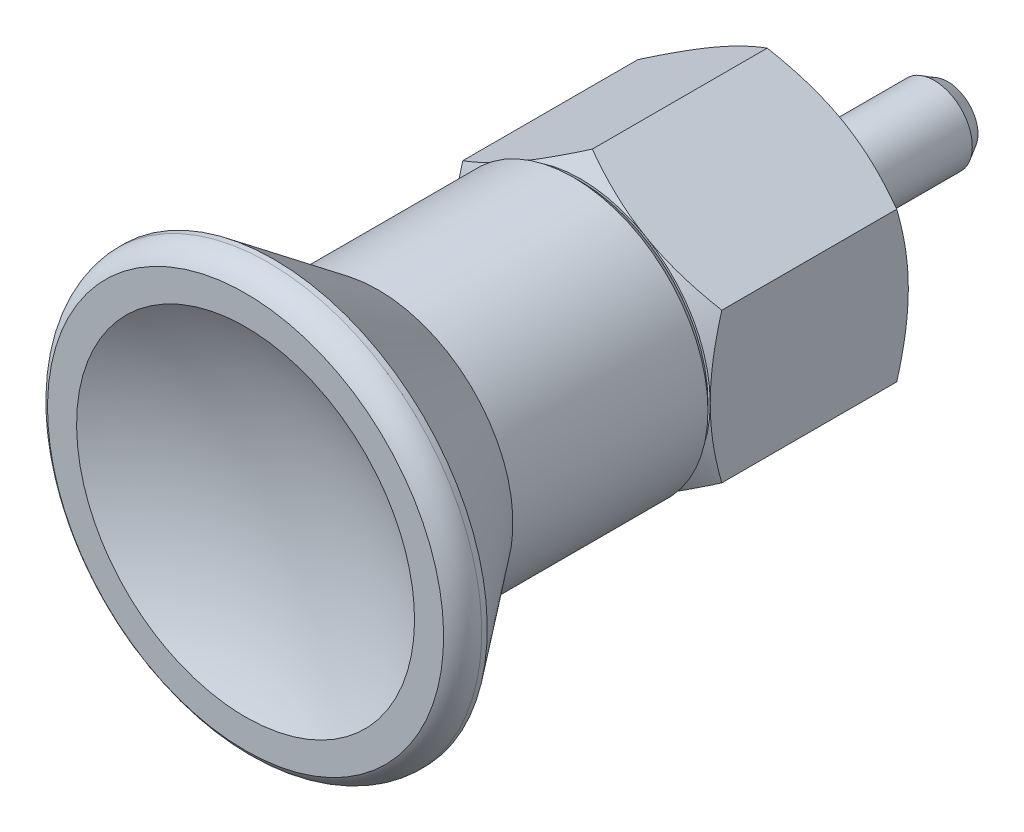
ISO-10303-21;
HEADER;
FILE_DESCRIPTION(('STEP AP214'),'2;1');
FILE_NAME('part.step','',(''),(''),'','','');
FILE_SCHEMA(('AUTOMOTIVE_DESIGN { 1 0 10303 214 1 1 1 1 }'));
ENDSEC;
DATA;
#1=APPLICATION_CONTEXT('core data for automotive mechanical design processes');
#2=APPLICATION_PROTOCOL_DEFINITION('international standard','automotive_design',2000,#1);
#3=PRODUCT_CONTEXT('',#1,'mechanical');
#4=PRODUCT('Part','Part','',(#3));
#5=PRODUCT_RELATED_PRODUCT_CATEGORY('part','',(#4));
#6=PRODUCT_DEFINITION_FORMATION('','',#4);
#7=PRODUCT_DEFINITION_CONTEXT('part definition',#1,'design');
#8=PRODUCT_DEFINITION('design','',#6,#7);
#9=PRODUCT_DEFINITION_SHAPE('','',#8);
#10=(LENGTH_UNIT() NAMED_UNIT(*) SI_UNIT(.MILLI.,.METRE.));
#11=(NAMED_UNIT(*) PLANE_ANGLE_UNIT() SI_UNIT($,.RADIAN.));
#12=(NAMED_UNIT(*) SI_UNIT($,.STERADIAN.) SOLID_ANGLE_UNIT());
#13=UNCERTAINTY_MEASURE_WITH_UNIT(LENGTH_MEASURE(1.E-05),#10,'distance_accuracy_value','');
#14=(GEOMETRIC_REPRESENTATION_CONTEXT(3) GLOBAL_UNCERTAINTY_ASSIGNED_CONTEXT((#13)) GLOBAL_UNIT_ASSIGNED_CONTEXT((#10,
#11,#12)) REPRESENTATION_CONTEXT('',''));
#15=CARTESIAN_POINT('',(0.,0.,0.));
#16=DIRECTION('',(0.,0.,1.));
#17=DIRECTION('',(1.,0.,0.));
#18=AXIS2_PLACEMENT_3D('',#15,#16,#17);
#19=CARTESIAN_POINT('',(-8.5,0.,0.));
#20=DIRECTION('',(0.,0.,1.));
#21=DIRECTION('',(0.,1.,0.));
#22=AXIS2_PLACEMENT_3D('',#19,#20,#21);
#23=PLANE('',#22);
#24=CARTESIAN_POINT('',(0.,0.,0.));
#25=DIRECTION('',(0.,0.,1.));
#26=DIRECTION('',(1.,0.,0.));
#27=AXIS2_PLACEMENT_3D('',#24,#25,#26);
#28=CIRCLE('',#27,8.5);
#29=CARTESIAN_POINT('',(-4.25,7.36121593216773,0.));
#30=VERTEX_POINT('',#29);
#31=CARTESIAN_POINT('',(-8.5,0.,0.));
#32=VERTEX_POINT('',#31);
#33=EDGE_CURVE('E489',#30,#32,#28,.T.);
#34=ORIENTED_EDGE('',*,*,#33,.F.);
#35=CARTESIAN_POINT('',(0.,0.,0.));
#36=DIRECTION('',(0.,0.,1.));
#37=DIRECTION('',(1.,0.,0.));
#38=AXIS2_PLACEMENT_3D('',#35,#36,#37);
#39=CIRCLE('',#38,8.5);
#40=CARTESIAN_POINT('',(4.25,7.36121593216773,0.));
#41=VERTEX_POINT('',#40);
#42=EDGE_CURVE('E106',#41,#30,#39,.T.);
#43=ORIENTED_EDGE('',*,*,#42,.F.);
#44=CARTESIAN_POINT('',(0.,0.,0.));
#45=DIRECTION('',(0.,0.,1.));
#46=DIRECTION('',(1.,0.,0.));
#47=AXIS2_PLACEMENT_3D('',#44,#45,#46);
#48=CIRCLE('',#47,8.5);
#49=CARTESIAN_POINT('',(8.5,0.,0.));
#50=VERTEX_POINT('',#49);
#51=EDGE_CURVE('E99',#50,#41,#48,.T.);
#52=ORIENTED_EDGE('',*,*,#51,.F.);
#53=CARTESIAN_POINT('',(0.,0.,0.));
#54=DIRECTION('',(0.,0.,1.));
#55=DIRECTION('',(0.,1.,0.));
#56=AXIS2_PLACEMENT_3D('',#53,#54,#55);
#57=CIRCLE('',#56,8.5);
#58=CARTESIAN_POINT('',(4.25,-7.36121593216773,0.));
#59=VERTEX_POINT('',#58);
#60=EDGE_CURVE('E103',#59,#50,#57,.T.);
#61=ORIENTED_EDGE('',*,*,#60,.F.);
#62=CARTESIAN_POINT('',(0.,0.,0.));
#63=DIRECTION('',(0.,0.,1.));
#64=DIRECTION('',(1.,0.,0.));
#65=AXIS2_PLACEMENT_3D('',#62,#63,#64);
#66=CIRCLE('',#65,8.5);
#67=CARTESIAN_POINT('',(-4.25,-7.36121593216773,0.));
#68=VERTEX_POINT('',#67);
#69=EDGE_CURVE('E127',#68,#59,#66,.T.);
#70=ORIENTED_EDGE('',*,*,#69,.F.);
#71=CARTESIAN_POINT('',(0.,0.,0.));
#72=DIRECTION('',(0.,0.,1.));
#73=DIRECTION('',(1.,0.,0.));
#74=AXIS2_PLACEMENT_3D('',#71,#72,#73);
#75=CIRCLE('',#74,8.5);
#76=EDGE_CURVE('E517',#32,#68,#75,.T.);
#77=ORIENTED_EDGE('',*,*,#76,.F.);
#78=EDGE_LOOP('',(#34,#43,#52,#61,#70,#77));
#79=FACE_BOUND('',#78,.T.);
#80=CARTESIAN_POINT('',(0.,0.,0.));
#81=DIRECTION('',(0.,0.,1.));
#82=DIRECTION('',(0.,1.,0.));
#83=AXIS2_PLACEMENT_3D('',#80,#81,#82);
#84=CIRCLE('',#83,5.);
#85=CARTESIAN_POINT('',(0.,5.,0.));
#86=VERTEX_POINT('',#85);
#87=EDGE_CURVE('E522',#86,#86,#84,.T.);
#88=ORIENTED_EDGE('',*,*,#87,.T.);
#89=EDGE_LOOP('',(#88));
#90=FACE_BOUND('',#89,.T.);
#91=ADVANCED_FACE('F14',(#79,#90),#23,.F.);
#92=CARTESIAN_POINT('',(0.,0.,0.763744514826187));
#93=DIRECTION('',(0.,0.,1.));
#94=DIRECTION('',(1.,0.,0.));
#95=AXIS2_PLACEMENT_3D('',#92,#93,#94);
#96=CONICAL_SURFACE('',#95,9.82284430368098,1.0471975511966);
#97=CARTESIAN_POINT('',(4.25,7.36121593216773,0.));
#98=CARTESIAN_POINT('',(4.43038865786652,7.25706849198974,-3.47391832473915E-05));
#99=CARTESIAN_POINT('',(4.61076862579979,7.15292606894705,0.00441964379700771));
#100=CARTESIAN_POINT('',(4.97117438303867,6.94484570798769,0.0220484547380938));
#101=CARTESIAN_POINT('',(5.15120023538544,6.84090773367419,0.0352211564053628));
#102=CARTESIAN_POINT('',(5.50973493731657,6.63390762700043,0.0699416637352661));
#103=CARTESIAN_POINT('',(5.6882468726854,6.53084371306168,0.0914473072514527));
#104=CARTESIAN_POINT('',(6.04442025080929,6.32520691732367,0.142371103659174));
#105=CARTESIAN_POINT('',(6.22208167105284,6.22263404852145,0.171789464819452));
#106=CARTESIAN_POINT('',(6.75305373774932,5.91607718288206,0.271004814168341));
#107=CARTESIAN_POINT('',(7.10482189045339,5.71298374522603,0.351810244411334));
#108=CARTESIAN_POINT('',(7.8053331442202,5.3085433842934,0.538168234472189));
#109=CARTESIAN_POINT('',(8.15405181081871,5.1072105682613,0.643844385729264));
#110=CARTESIAN_POINT('',(8.5,4.90747728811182,0.759189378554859));
#111=B_SPLINE_CURVE_WITH_KNOTS('',3,(#97,#98,#99,#100,#101,#102,#103,#104,#105,#106,#107,#108,
#109,#110),.UNSPECIFIED.,.F.,.F.,(4,2,2,2,2,2,4),(0.,0.624820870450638,1.24951805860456,
1.87109489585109,2.4926880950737,3.73424531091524,4.98210763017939),.UNSPECIFIED.);
#112=CARTESIAN_POINT('',(8.5,4.90747728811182,0.75918937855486));
#113=VERTEX_POINT('',#112);
#114=EDGE_CURVE('E115',#41,#113,#111,.T.);
#115=ORIENTED_EDGE('',*,*,#114,.T.);
#116=CARTESIAN_POINT('',(8.5,4.90747728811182,0.75918937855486));
#117=CARTESIAN_POINT('',(8.5,4.50801072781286,0.643844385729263));
#118=CARTESIAN_POINT('',(8.5,4.10534509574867,0.538168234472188));
#119=CARTESIAN_POINT('',(8.5,3.2964643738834,0.351810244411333));
#120=CARTESIAN_POINT('',(8.5,2.89027749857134,0.271004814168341));
#121=CARTESIAN_POINT('',(8.5,2.27716376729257,0.171789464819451));
#122=CARTESIAN_POINT('',(8.5,2.07201802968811,0.142371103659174));
#123=CARTESIAN_POINT('',(8.5,1.66074443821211,0.0914473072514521));
#124=CARTESIAN_POINT('',(8.5,1.4546166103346,0.0699416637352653));
#125=CARTESIAN_POINT('',(8.5,1.04061639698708,0.0352211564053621));
#126=CARTESIAN_POINT('',(8.5,0.832740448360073,0.0220484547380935));
#127=CARTESIAN_POINT('',(8.5,0.416579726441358,0.00441964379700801));
#128=CARTESIAN_POINT('',(8.5,0.208294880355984,-3.47391832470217E-05));
#129=CARTESIAN_POINT('',(8.5,0.,0.));
#130=B_SPLINE_CURVE_WITH_KNOTS('',3,(#116,#117,#118,#119,#120,#121,#122,#123,#124,#125,#126,
#127,#128,#129),.UNSPECIFIED.,.F.,.F.,(4,2,2,2,2,2,4),(0.,1.24786231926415,2.4894195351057,
3.1110127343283,3.73258957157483,4.35728675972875,4.98210763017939),.UNSPECIFIED.);
#131=EDGE_CURVE('E113',#113,#50,#130,.T.);
#132=ORIENTED_EDGE('',*,*,#131,.T.);
#133=ORIENTED_EDGE('',*,*,#51,.T.);
#134=EDGE_LOOP('',(#115,#132,#133));
#135=FACE_BOUND('',#134,.T.);
#136=ADVANCED_FACE('F114',(#135),#96,.T.);
#137=CARTESIAN_POINT('',(0.,0.,0.763744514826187));
#138=DIRECTION('',(0.,0.,1.));
#139=DIRECTION('',(0.,1.,0.));
#140=AXIS2_PLACEMENT_3D('',#137,#138,#139);
#141=CONICAL_SURFACE('',#140,9.82284430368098,1.0471975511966);
#142=CARTESIAN_POINT('',(8.5,-4.90747728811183,0.759189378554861));
#143=CARTESIAN_POINT('',(8.15405181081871,-5.1072105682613,0.643844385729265));
#144=CARTESIAN_POINT('',(7.8053331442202,-5.3085433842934,0.538168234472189));
#145=CARTESIAN_POINT('',(7.10482189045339,-5.71298374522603,0.351810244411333));
#146=CARTESIAN_POINT('',(6.75305373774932,-5.91607718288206,0.271004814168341));
#147=CARTESIAN_POINT('',(6.22208167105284,-6.22263404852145,0.171789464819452));
#148=CARTESIAN_POINT('',(6.04442025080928,-6.32520691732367,0.142371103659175));
#149=CARTESIAN_POINT('',(5.6882468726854,-6.53084371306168,0.0914473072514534));
#150=CARTESIAN_POINT('',(5.50973493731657,-6.63390762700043,0.0699416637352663));
#151=CARTESIAN_POINT('',(5.15120023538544,-6.84090773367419,0.0352211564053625));
#152=CARTESIAN_POINT('',(4.97117438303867,-6.94484570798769,0.0220484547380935));
#153=CARTESIAN_POINT('',(4.61076862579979,-7.15292606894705,0.004419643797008));
#154=CARTESIAN_POINT('',(4.43038865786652,-7.25706849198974,-3.4739183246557E-05));
#155=CARTESIAN_POINT('',(4.25,-7.36121593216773,0.));
#156=B_SPLINE_CURVE_WITH_KNOTS('',3,(#142,#143,#144,#145,#146,#147,#148,#149,#150,#151,#152,
#153,#154,#155),.UNSPECIFIED.,.F.,.F.,(4,2,2,2,2,2,4),(0.,1.24786231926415,2.48941953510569,
3.1110127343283,3.73258957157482,4.35728675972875,4.98210763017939),.UNSPECIFIED.);
#157=CARTESIAN_POINT('',(8.5,-4.90747728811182,0.759189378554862));
#158=VERTEX_POINT('',#157);
#159=EDGE_CURVE('E125',#158,#59,#156,.T.);
#160=ORIENTED_EDGE('',*,*,#159,.T.);
#161=ORIENTED_EDGE('',*,*,#60,.T.);
#162=CARTESIAN_POINT('',(8.5,0.,0.));
#163=CARTESIAN_POINT('',(8.5,-0.208294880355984,-3.47391832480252E-05));
#164=CARTESIAN_POINT('',(8.5,-0.416579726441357,0.00441964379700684));
#165=CARTESIAN_POINT('',(8.5,-0.832740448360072,0.0220484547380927));
#166=CARTESIAN_POINT('',(8.5,-1.04061639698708,0.0352211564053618));
#167=CARTESIAN_POINT('',(8.5,-1.4546166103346,0.0699416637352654));
#168=CARTESIAN_POINT('',(8.5,-1.66074443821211,0.0914473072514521));
#169=CARTESIAN_POINT('',(8.5,-2.07201802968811,0.142371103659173));
#170=CARTESIAN_POINT('',(8.5,-2.27716376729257,0.171789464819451));
#171=CARTESIAN_POINT('',(8.5,-2.89027749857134,0.271004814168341));
#172=CARTESIAN_POINT('',(8.5,-3.2964643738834,0.351810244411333));
#173=CARTESIAN_POINT('',(8.5,-4.10534509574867,0.538168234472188));
#174=CARTESIAN_POINT('',(8.5,-4.50801072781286,0.643844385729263));
#175=CARTESIAN_POINT('',(8.5,-4.90747728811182,0.75918937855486));
#176=B_SPLINE_CURVE_WITH_KNOTS('',3,(#162,#163,#164,#165,#166,#167,#168,#169,#170,#171,#172,
#173,#174,#175),.UNSPECIFIED.,.F.,.F.,(4,2,2,2,2,2,4),(0.,0.624820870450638,1.24951805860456,
1.87109489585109,2.4926880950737,3.73424531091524,4.98210763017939),.UNSPECIFIED.);
#177=EDGE_CURVE('E119',#50,#158,#176,.T.);
#178=ORIENTED_EDGE('',*,*,#177,.T.);
#179=EDGE_LOOP('',(#160,#161,#178));
#180=FACE_BOUND('',#179,.T.);
#181=ADVANCED_FACE('F122',(#180),#141,.T.);
#182=CARTESIAN_POINT('',(0.,0.,0.763744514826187));
#183=DIRECTION('',(0.,0.,1.));
#184=DIRECTION('',(1.,0.,0.));
#185=AXIS2_PLACEMENT_3D('',#182,#183,#184);
#186=CONICAL_SURFACE('',#185,9.82284430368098,1.0471975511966);
#187=CARTESIAN_POINT('',(4.25,-7.36121593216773,0.));
#188=CARTESIAN_POINT('',(4.06961134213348,-7.46536337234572,-3.47391832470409E-05));
#189=CARTESIAN_POINT('',(3.88923137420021,-7.56950579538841,0.00441964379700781));
#190=CARTESIAN_POINT('',(3.52882561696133,-7.77758615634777,0.0220484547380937));
#191=CARTESIAN_POINT('',(3.34879976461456,-7.88152413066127,0.0352211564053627));
#192=CARTESIAN_POINT('',(2.99026506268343,-8.08852423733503,0.069941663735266));
#193=CARTESIAN_POINT('',(2.8117531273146,-8.19158815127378,0.0914473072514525));
#194=CARTESIAN_POINT('',(2.45557974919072,-8.39722494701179,0.142371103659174));
#195=CARTESIAN_POINT('',(2.27791832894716,-8.49979781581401,0.171789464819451));
#196=CARTESIAN_POINT('',(1.74694626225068,-8.8063546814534,0.271004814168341));
#197=CARTESIAN_POINT('',(1.39517810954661,-9.00944811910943,0.351810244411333));
#198=CARTESIAN_POINT('',(0.694666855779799,-9.41388848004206,0.538168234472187));
#199=CARTESIAN_POINT('',(0.345948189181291,-9.61522129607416,0.643844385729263));
#200=CARTESIAN_POINT('',(0.,-9.81495457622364,0.75918937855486));
#201=B_SPLINE_CURVE_WITH_KNOTS('',3,(#187,#188,#189,#190,#191,#192,#193,#194,#195,#196,#197,
#198,#199,#200),.UNSPECIFIED.,.F.,.F.,(4,2,2,2,2,2,4),(0.,0.624820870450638,1.24951805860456,
1.87109489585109,2.49268809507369,3.73424531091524,4.98210763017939),.UNSPECIFIED.);
#202=CARTESIAN_POINT('',(0.,-9.81495457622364,0.75918937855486));
#203=VERTEX_POINT('',#202);
#204=EDGE_CURVE('E330',#59,#203,#201,.T.);
#205=ORIENTED_EDGE('',*,*,#204,.T.);
#206=CARTESIAN_POINT('',(0.,-9.81495457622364,0.759189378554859));
#207=CARTESIAN_POINT('',(-0.345948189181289,-9.61522129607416,0.643844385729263));
#208=CARTESIAN_POINT('',(-0.694666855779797,-9.41388848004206,0.538168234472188));
#209=CARTESIAN_POINT('',(-1.39517810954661,-9.00944811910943,0.351810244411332));
#210=CARTESIAN_POINT('',(-1.74694626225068,-8.8063546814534,0.27100481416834));
#211=CARTESIAN_POINT('',(-2.27791832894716,-8.49979781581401,0.171789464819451));
#212=CARTESIAN_POINT('',(-2.45557974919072,-8.39722494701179,0.142371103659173));
#213=CARTESIAN_POINT('',(-2.8117531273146,-8.19158815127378,0.0914473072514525));
#214=CARTESIAN_POINT('',(-2.99026506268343,-8.08852423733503,0.0699416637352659));
#215=CARTESIAN_POINT('',(-3.34879976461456,-7.88152413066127,0.0352211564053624));
#216=CARTESIAN_POINT('',(-3.52882561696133,-7.77758615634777,0.0220484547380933));
#217=CARTESIAN_POINT('',(-3.88923137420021,-7.56950579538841,0.00441964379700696));
#218=CARTESIAN_POINT('',(-4.06961134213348,-7.46536337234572,-3.47391832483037E-05));
#219=CARTESIAN_POINT('',(-4.25,-7.36121593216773,0.));
#220=B_SPLINE_CURVE_WITH_KNOTS('',3,(#206,#207,#208,#209,#210,#211,#212,#213,#214,#215,#216,
#217,#218,#219),.UNSPECIFIED.,.F.,.F.,(4,2,2,2,2,2,4),(0.,1.24786231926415,2.48941953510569,
3.1110127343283,3.73258957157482,4.35728675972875,4.98210763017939),.UNSPECIFIED.);
#221=EDGE_CURVE('E324',#203,#68,#220,.T.);
#222=ORIENTED_EDGE('',*,*,#221,.T.);
#223=ORIENTED_EDGE('',*,*,#69,.T.);
#224=EDGE_LOOP('',(#205,#222,#223));
#225=FACE_BOUND('',#224,.T.);
#226=ADVANCED_FACE('F159',(#225),#186,.T.);
#227=CARTESIAN_POINT('',(0.,0.,0.763744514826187));
#228=DIRECTION('',(0.,0.,1.));
#229=DIRECTION('',(1.,0.,0.));
#230=AXIS2_PLACEMENT_3D('',#227,#228,#229);
#231=CONICAL_SURFACE('',#230,9.82284430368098,1.0471975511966);
#232=CARTESIAN_POINT('',(-4.25,7.36121593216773,0.));
#233=CARTESIAN_POINT('',(-4.06961134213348,7.46536337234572,-3.47391832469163E-05));
#234=CARTESIAN_POINT('',(-3.88923137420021,7.56950579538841,0.00441964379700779));
#235=CARTESIAN_POINT('',(-3.52882561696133,7.77758615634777,0.0220484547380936));
#236=CARTESIAN_POINT('',(-3.34879976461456,7.88152413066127,0.0352211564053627));
#237=CARTESIAN_POINT('',(-2.99026506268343,8.08852423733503,0.0699416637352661));
#238=CARTESIAN_POINT('',(-2.8117531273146,8.19158815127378,0.0914473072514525));
#239=CARTESIAN_POINT('',(-2.45557974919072,8.39722494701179,0.142371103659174));
#240=CARTESIAN_POINT('',(-2.27791832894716,8.49979781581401,0.171789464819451));
#241=CARTESIAN_POINT('',(-1.74694626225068,8.8063546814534,0.271004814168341));
#242=CARTESIAN_POINT('',(-1.39517810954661,9.00944811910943,0.351810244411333));
#243=CARTESIAN_POINT('',(-0.694666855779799,9.41388848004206,0.538168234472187));
#244=CARTESIAN_POINT('',(-0.345948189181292,9.61522129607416,0.643844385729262));
#245=CARTESIAN_POINT('',(0.,9.81495457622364,0.75918937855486));
#246=B_SPLINE_CURVE_WITH_KNOTS('',3,(#232,#233,#234,#235,#236,#237,#238,#239,#240,#241,#242,
#243,#244,#245),.UNSPECIFIED.,.F.,.F.,(4,2,2,2,2,2,4),(0.,0.624820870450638,1.24951805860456,
1.87109489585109,2.49268809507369,3.73424531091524,4.98210763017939),.UNSPECIFIED.);
#247=CARTESIAN_POINT('',(0.,9.81495457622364,0.759189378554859));
#248=VERTEX_POINT('',#247);
#249=EDGE_CURVE('E445',#30,#248,#246,.T.);
#250=ORIENTED_EDGE('',*,*,#249,.T.);
#251=CARTESIAN_POINT('',(0.,9.81495457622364,0.759189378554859));
#252=CARTESIAN_POINT('',(0.345948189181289,9.61522129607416,0.643844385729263));
#253=CARTESIAN_POINT('',(0.694666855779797,9.41388848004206,0.538168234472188));
#254=CARTESIAN_POINT('',(1.39517810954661,9.00944811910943,0.351810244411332));
#255=CARTESIAN_POINT('',(1.74694626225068,8.8063546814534,0.27100481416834));
#256=CARTESIAN_POINT('',(2.27791832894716,8.49979781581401,0.171789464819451));
#257=CARTESIAN_POINT('',(2.45557974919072,8.39722494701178,0.142371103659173));
#258=CARTESIAN_POINT('',(2.8117531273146,8.19158815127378,0.0914473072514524));
#259=CARTESIAN_POINT('',(2.99026506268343,8.08852423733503,0.0699416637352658));
#260=CARTESIAN_POINT('',(3.34879976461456,7.88152413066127,0.0352211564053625));
#261=CARTESIAN_POINT('',(3.52882561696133,7.77758615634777,0.0220484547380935));
#262=CARTESIAN_POINT('',(3.88923137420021,7.56950579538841,0.00441964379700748));
#263=CARTESIAN_POINT('',(4.06961134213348,7.46536337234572,-3.47391832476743E-05));
#264=CARTESIAN_POINT('',(4.25,7.36121593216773,0.));
#265=B_SPLINE_CURVE_WITH_KNOTS('',3,(#251,#252,#253,#254,#255,#256,#257,#258,#259,#260,#261,
#262,#263,#264),.UNSPECIFIED.,.F.,.F.,(4,2,2,2,2,2,4),(0.,1.24786231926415,2.48941953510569,
3.1110127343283,3.73258957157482,4.35728675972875,4.98210763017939),.UNSPECIFIED.);
#266=EDGE_CURVE('E173',#248,#41,#265,.T.);
#267=ORIENTED_EDGE('',*,*,#266,.T.);
#268=ORIENTED_EDGE('',*,*,#42,.T.);
#269=EDGE_LOOP('',(#250,#267,#268));
#270=FACE_BOUND('',#269,.T.);
#271=ADVANCED_FACE('F467',(#270),#231,.T.);
#272=CARTESIAN_POINT('',(0.,0.,0.763744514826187));
#273=DIRECTION('',(0.,0.,1.));
#274=DIRECTION('',(1.,0.,0.));
#275=AXIS2_PLACEMENT_3D('',#272,#273,#274);
#276=CONICAL_SURFACE('',#275,9.82284430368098,1.0471975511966);
#277=CARTESIAN_POINT('',(-4.25,-7.36121593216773,0.));
#278=CARTESIAN_POINT('',(-4.43038865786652,-7.25706849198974,-3.47391832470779E-05));
#279=CARTESIAN_POINT('',(-4.61076862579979,-7.15292606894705,0.00441964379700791));
#280=CARTESIAN_POINT('',(-4.97117438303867,-6.94484570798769,0.0220484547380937));
#281=CARTESIAN_POINT('',(-5.15120023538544,-6.84090773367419,0.0352211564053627));
#282=CARTESIAN_POINT('',(-5.50973493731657,-6.63390762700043,0.0699416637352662));
#283=CARTESIAN_POINT('',(-5.6882468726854,-6.53084371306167,0.091447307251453));
#284=CARTESIAN_POINT('',(-6.04442025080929,-6.32520691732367,0.142371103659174));
#285=CARTESIAN_POINT('',(-6.22208167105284,-6.22263404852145,0.171789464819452));
#286=CARTESIAN_POINT('',(-6.75305373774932,-5.91607718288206,0.271004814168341));
#287=CARTESIAN_POINT('',(-7.10482189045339,-5.71298374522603,0.351810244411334));
#288=CARTESIAN_POINT('',(-7.8053331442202,-5.3085433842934,0.538168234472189));
#289=CARTESIAN_POINT('',(-8.15405181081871,-5.1072105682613,0.643844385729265));
#290=CARTESIAN_POINT('',(-8.5,-4.90747728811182,0.75918937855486));
#291=B_SPLINE_CURVE_WITH_KNOTS('',3,(#277,#278,#279,#280,#281,#282,#283,#284,#285,#286,#287,
#288,#289,#290),.UNSPECIFIED.,.F.,.F.,(4,2,2,2,2,2,4),(0.,0.624820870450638,1.24951805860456,
1.87109489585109,2.4926880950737,3.73424531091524,4.98210763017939),.UNSPECIFIED.);
#292=CARTESIAN_POINT('',(-8.5,-4.90747728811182,0.75918937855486));
#293=VERTEX_POINT('',#292);
#294=EDGE_CURVE('E315',#68,#293,#291,.T.);
#295=ORIENTED_EDGE('',*,*,#294,.T.);
#296=CARTESIAN_POINT('',(-8.5,-4.90747728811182,0.75918937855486));
#297=CARTESIAN_POINT('',(-8.5,-4.50801072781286,0.643844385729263));
#298=CARTESIAN_POINT('',(-8.5,-4.10534509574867,0.538168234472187));
#299=CARTESIAN_POINT('',(-8.5,-3.2964643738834,0.351810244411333));
#300=CARTESIAN_POINT('',(-8.5,-2.89027749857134,0.271004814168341));
#301=CARTESIAN_POINT('',(-8.5,-2.27716376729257,0.171789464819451));
#302=CARTESIAN_POINT('',(-8.5,-2.07201802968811,0.142371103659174));
#303=CARTESIAN_POINT('',(-8.5,-1.66074443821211,0.0914473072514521));
#304=CARTESIAN_POINT('',(-8.5,-1.4546166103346,0.0699416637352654));
#305=CARTESIAN_POINT('',(-8.5,-1.04061639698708,0.0352211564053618));
#306=CARTESIAN_POINT('',(-8.5,-0.832740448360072,0.0220484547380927));
#307=CARTESIAN_POINT('',(-8.5,-0.416579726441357,0.00441964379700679));
#308=CARTESIAN_POINT('',(-8.5,-0.208294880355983,-3.47391832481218E-05));
#309=CARTESIAN_POINT('',(-8.5,0.,0.));
#310=B_SPLINE_CURVE_WITH_KNOTS('',3,(#296,#297,#298,#299,#300,#301,#302,#303,#304,#305,#306,
#307,#308,#309),.UNSPECIFIED.,.F.,.F.,(4,2,2,2,2,2,4),(0.,1.24786231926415,2.4894195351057,
3.1110127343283,3.73258957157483,4.35728675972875,4.98210763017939),.UNSPECIFIED.);
#311=EDGE_CURVE('E444',#293,#32,#310,.T.);
#312=ORIENTED_EDGE('',*,*,#311,.T.);
#313=ORIENTED_EDGE('',*,*,#76,.T.);
#314=EDGE_LOOP('',(#295,#312,#313));
#315=FACE_BOUND('',#314,.T.);
#316=ADVANCED_FACE('F470',(#315),#276,.T.);
#317=CARTESIAN_POINT('',(0.,0.,0.763744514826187));
#318=DIRECTION('',(0.,0.,1.));
#319=DIRECTION('',(1.,0.,0.));
#320=AXIS2_PLACEMENT_3D('',#317,#318,#319);
#321=CONICAL_SURFACE('',#320,9.82284430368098,1.0471975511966);
#322=CARTESIAN_POINT('',(-8.5,0.,0.));
#323=CARTESIAN_POINT('',(-8.5,0.208294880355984,-3.47391832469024E-05));
#324=CARTESIAN_POINT('',(-8.5,0.416579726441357,0.00441964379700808));
#325=CARTESIAN_POINT('',(-8.5,0.832740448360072,0.0220484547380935));
#326=CARTESIAN_POINT('',(-8.5,1.04061639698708,0.035221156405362));
#327=CARTESIAN_POINT('',(-8.5,1.4546166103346,0.0699416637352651));
#328=CARTESIAN_POINT('',(-8.5,1.66074443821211,0.091447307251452));
#329=CARTESIAN_POINT('',(-8.5,2.07201802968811,0.142371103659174));
#330=CARTESIAN_POINT('',(-8.5,2.27716376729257,0.171789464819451));
#331=CARTESIAN_POINT('',(-8.5,2.89027749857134,0.271004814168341));
#332=CARTESIAN_POINT('',(-8.5,3.2964643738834,0.351810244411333));
#333=CARTESIAN_POINT('',(-8.5,4.10534509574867,0.538168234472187));
#334=CARTESIAN_POINT('',(-8.5,4.50801072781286,0.643844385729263));
#335=CARTESIAN_POINT('',(-8.5,4.90747728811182,0.75918937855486));
#336=B_SPLINE_CURVE_WITH_KNOTS('',3,(#322,#323,#324,#325,#326,#327,#328,#329,#330,#331,#332,
#333,#334,#335),.UNSPECIFIED.,.F.,.F.,(4,2,2,2,2,2,4),(0.,0.624820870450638,1.24951805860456,
1.87109489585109,2.4926880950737,3.73424531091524,4.98210763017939),.UNSPECIFIED.);
#337=CARTESIAN_POINT('',(-8.5,4.90747728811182,0.759189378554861));
#338=VERTEX_POINT('',#337);
#339=EDGE_CURVE('E243',#32,#338,#336,.T.);
#340=ORIENTED_EDGE('',*,*,#339,.T.);
#341=CARTESIAN_POINT('',(-8.5,4.90747728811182,0.759189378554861));
#342=CARTESIAN_POINT('',(-8.15405181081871,5.1072105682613,0.643844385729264));
#343=CARTESIAN_POINT('',(-7.8053331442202,5.3085433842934,0.538168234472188));
#344=CARTESIAN_POINT('',(-7.10482189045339,5.71298374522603,0.351810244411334));
#345=CARTESIAN_POINT('',(-6.75305373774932,5.91607718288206,0.271004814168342));
#346=CARTESIAN_POINT('',(-6.22208167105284,6.22263404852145,0.171789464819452));
#347=CARTESIAN_POINT('',(-6.04442025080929,6.32520691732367,0.142371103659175));
#348=CARTESIAN_POINT('',(-5.6882468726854,6.53084371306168,0.0914473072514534));
#349=CARTESIAN_POINT('',(-5.50973493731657,6.63390762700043,0.0699416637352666));
#350=CARTESIAN_POINT('',(-5.15120023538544,6.84090773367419,0.0352211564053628));
#351=CARTESIAN_POINT('',(-4.97117438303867,6.94484570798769,0.0220484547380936));
#352=CARTESIAN_POINT('',(-4.61076862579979,7.15292606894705,0.00441964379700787));
#353=CARTESIAN_POINT('',(-4.43038865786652,7.25706849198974,-3.47391832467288E-05));
#354=CARTESIAN_POINT('',(-4.25,7.36121593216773,0.));
#355=B_SPLINE_CURVE_WITH_KNOTS('',3,(#341,#342,#343,#344,#345,#346,#347,#348,#349,#350,#351,
#352,#353,#354),.UNSPECIFIED.,.F.,.F.,(4,2,2,2,2,2,4),(0.,1.24786231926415,2.48941953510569,
3.1110127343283,3.73258957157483,4.35728675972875,4.98210763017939),.UNSPECIFIED.);
#356=EDGE_CURVE('E450',#338,#30,#355,.T.);
#357=ORIENTED_EDGE('',*,*,#356,.T.);
#358=ORIENTED_EDGE('',*,*,#33,.T.);
#359=EDGE_LOOP('',(#340,#357,#358));
#360=FACE_BOUND('',#359,.T.);
#361=ADVANCED_FACE('F474',(#360),#321,.T.);
#362=CARTESIAN_POINT('',(0.,0.,54.));
#363=DIRECTION('',(1.,0.,0.));
#364=DIRECTION('',(0.,-1.,0.));
#365=AXIS2_PLACEMENT_3D('',#362,#363,#364);
#366=SPHERICAL_SURFACE('',#365,22.);
#367=CARTESIAN_POINT('',(0.,-11.0905365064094,35.));
#368=CARTESIAN_POINT('',(0.311592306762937,-11.0905387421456,35.));
#369=CARTESIAN_POINT('',(0.623147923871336,-11.0773996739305,35.));
#370=CARTESIAN_POINT('',(1.2441486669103,-11.0249351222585,35.));
#371=CARTESIAN_POINT('',(1.55359321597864,-10.9856027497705,35.));
#372=CARTESIAN_POINT('',(2.16839724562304,-10.8809650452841,35.));
#373=CARTESIAN_POINT('',(2.47375196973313,-10.8156317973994,35.));
#374=CARTESIAN_POINT('',(3.07786779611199,-10.6594588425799,35.));
#375=CARTESIAN_POINT('',(3.37662892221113,-10.5686192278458,35.));
#376=CARTESIAN_POINT('',(3.96528771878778,-10.3621299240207,35.));
#377=CARTESIAN_POINT('',(4.25518961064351,-10.2464922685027,35.));
#378=CARTESIAN_POINT('',(4.82422457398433,-9.99120122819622,35.));
#379=CARTESIAN_POINT('',(5.10335747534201,-9.85154746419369,35.));
#380=CARTESIAN_POINT('',(5.64879485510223,-9.54925716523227,35.));
#381=CARTESIAN_POINT('',(5.9151025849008,-9.38662649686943,35.));
#382=CARTESIAN_POINT('',(6.4330719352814,-9.03951216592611,35.));
#383=CARTESIAN_POINT('',(6.68473361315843,-8.85502858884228,35.));
#384=CARTESIAN_POINT('',(7.17164914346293,-8.46549844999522,35.));
#385=CARTESIAN_POINT('',(7.40690124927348,-8.26044970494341,35.));
#386=CARTESIAN_POINT('',(7.85929603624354,-7.83126308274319,35.));
#387=CARTESIAN_POINT('',(8.07643869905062,-7.60712518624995,35.));
#388=CARTESIAN_POINT('',(8.49107872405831,-7.14134478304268,35.));
#389=CARTESIAN_POINT('',(8.68857532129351,-6.89970159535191,35.));
#390=CARTESIAN_POINT('',(9.06250942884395,-6.40063637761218,35.));
#391=CARTESIAN_POINT('',(9.23894694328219,-6.14321435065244,35.));
#392=CARTESIAN_POINT('',(9.56950544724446,-5.61442651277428,35.));
#393=CARTESIAN_POINT('',(9.72362685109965,-5.34306096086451,35.));
#394=CARTESIAN_POINT('',(10.008461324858,-4.78831092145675,35.));
#395=CARTESIAN_POINT('',(10.1391743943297,-4.5049264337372,35.));
#396=CARTESIAN_POINT('',(10.3762626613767,-3.92815381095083,35.));
#397=CARTESIAN_POINT('',(10.4826379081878,-3.6347656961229,35.));
#398=CARTESIAN_POINT('',(10.6702946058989,-3.04007108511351,35.));
#399=CARTESIAN_POINT('',(10.7515760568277,-2.73876458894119,35.));
#400=CARTESIAN_POINT('',(10.8884674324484,-2.13037473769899,35.));
#401=CARTESIAN_POINT('',(10.9440773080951,-1.82329137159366,35.));
#402=CARTESIAN_POINT('',(11.0292299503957,-1.20553152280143,35.));
#403=CARTESIAN_POINT('',(11.0587727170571,-0.894855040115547,35.));
#404=CARTESIAN_POINT('',(11.0915810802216,-0.272118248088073,35.));
#405=CARTESIAN_POINT('',(11.0948467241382,0.039942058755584,35.));
#406=CARTESIAN_POINT('',(11.0750777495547,0.66322849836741,35.));
#407=CARTESIAN_POINT('',(11.0520431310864,0.974454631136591,35.));
#408=CARTESIAN_POINT('',(10.9798373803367,1.5938602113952,35.));
#409=CARTESIAN_POINT('',(10.9306662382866,1.90203965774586,35.));
#410=CARTESIAN_POINT('',(10.8065370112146,2.51316077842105,35.));
#411=CARTESIAN_POINT('',(10.7315789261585,2.81610245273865,35.));
#412=CARTESIAN_POINT('',(10.5564086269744,3.41459461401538,35.));
#413=CARTESIAN_POINT('',(10.4561963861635,3.71014509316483,35.));
#414=CARTESIAN_POINT('',(10.2312302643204,4.2917533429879,35.));
#415=CARTESIAN_POINT('',(10.1064763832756,4.57781111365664,35.));
#416=CARTESIAN_POINT('',(9.83331395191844,5.13840015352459,35.));
#417=CARTESIAN_POINT('',(9.68490540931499,5.41293142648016,35.));
#418=CARTESIAN_POINT('',(9.36548872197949,5.94851581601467,35.));
#419=CARTESIAN_POINT('',(9.19448057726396,6.20956893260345,35.));
#420=CARTESIAN_POINT('',(8.83108052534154,6.71634097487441,35.));
#421=CARTESIAN_POINT('',(8.63868862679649,6.96205990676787,35.));
#422=CARTESIAN_POINT('',(8.2338888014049,7.43641678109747,35.));
#423=CARTESIAN_POINT('',(8.02148087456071,7.66505472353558,35.));
#424=CARTESIAN_POINT('',(7.57815905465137,8.10362417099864,35.));
#425=CARTESIAN_POINT('',(7.34724515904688,8.3135556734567,35.));
#426=CARTESIAN_POINT('',(6.86855308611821,8.7132197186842,35.));
#427=CARTESIAN_POINT('',(6.62077490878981,8.90295226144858,35.));
#428=CARTESIAN_POINT('',(6.11011579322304,9.26086952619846,35.));
#429=CARTESIAN_POINT('',(5.84723485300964,9.4290542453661,35.));
#430=CARTESIAN_POINT('',(5.30823916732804,9.7426801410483,35.));
#431=CARTESIAN_POINT('',(5.03212442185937,9.88812131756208,35.));
#432=CARTESIAN_POINT('',(4.46862414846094,10.1552261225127,35.));
#433=CARTESIAN_POINT('',(4.18123862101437,10.276889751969,35.));
#434=CARTESIAN_POINT('',(3.59723991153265,10.4955745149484,35.));
#435=CARTESIAN_POINT('',(3.30062672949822,10.5925956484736,35.));
#436=CARTESIAN_POINT('',(2.70028146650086,10.7613056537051,35.));
#437=CARTESIAN_POINT('',(2.39654938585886,10.8329945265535,35.));
#438=CARTESIAN_POINT('',(1.78412566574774,10.9505303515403,35.));
#439=CARTESIAN_POINT('',(1.47543402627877,10.9963773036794,35.));
#440=CARTESIAN_POINT('',(0.855285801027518,11.0619033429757,35.));
#441=CARTESIAN_POINT('',(0.543829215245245,11.0815824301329,35.));
#442=CARTESIAN_POINT('',(-0.0796346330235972,11.0946328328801,35.));
#443=CARTESIAN_POINT('',(-0.391641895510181,11.0880041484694,35.));
#444=CARTESIAN_POINT('',(-1.01398892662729,11.0484861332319,35.));
#445=CARTESIAN_POINT('',(-1.32432869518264,11.0155968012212,35.));
#446=CARTESIAN_POINT('',(-1.94113439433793,10.9237913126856,35.));
#447=CARTESIAN_POINT('',(-2.24760032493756,10.8648751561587,35.));
#448=CARTESIAN_POINT('',(-2.85447957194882,10.7214348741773,35.));
#449=CARTESIAN_POINT('',(-3.15489288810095,10.6369107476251,35.));
#450=CARTESIAN_POINT('',(-3.74753113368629,10.4428554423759,35.));
#451=CARTESIAN_POINT('',(-4.03975606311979,10.3333242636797,35.));
#452=CARTESIAN_POINT('',(-4.61393995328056,10.0900335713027,35.));
#453=CARTESIAN_POINT('',(-4.89589891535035,9.95627406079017,35.));
#454=CARTESIAN_POINT('',(-5.44754635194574,9.66547764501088,35.));
#455=CARTESIAN_POINT('',(-5.71723482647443,9.50844073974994,35.));
#456=CARTESIAN_POINT('',(-6.24242392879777,9.17220599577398,35.));
#457=CARTESIAN_POINT('',(-6.49792455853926,8.99300816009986,35.));
#458=CARTESIAN_POINT('',(-6.99292155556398,8.61372552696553,35.));
#459=CARTESIAN_POINT('',(-7.23241792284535,8.41364072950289,35.));
#460=CARTESIAN_POINT('',(-7.69370381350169,7.99400657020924,35.));
#461=CARTESIAN_POINT('',(-7.91549332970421,7.77445720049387,35.));
#462=CARTESIAN_POINT('',(-8.33978861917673,7.31745483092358,35.));
#463=CARTESIAN_POINT('',(-8.54229439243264,7.08000183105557,35.));
#464=CARTESIAN_POINT('',(-8.92658256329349,6.58888027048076,35.));
#465=CARTESIAN_POINT('',(-9.10836495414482,6.33521170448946,35.));
#466=CARTESIAN_POINT('',(-9.44991391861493,5.81346251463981,35.));
#467=CARTESIAN_POINT('',(-9.60968049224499,5.54538189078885,35.));
#468=CARTESIAN_POINT('',(-9.90606181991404,4.99671476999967,35.));
#469=CARTESIAN_POINT('',(-10.0426765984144,4.71612828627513,35.));
#470=CARTESIAN_POINT('',(-10.2917832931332,4.14444398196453,35.));
#471=CARTESIAN_POINT('',(-10.4042752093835,3.85334616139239,35.));
#472=CARTESIAN_POINT('',(-10.6043363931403,3.26270882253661,35.));
#473=CARTESIAN_POINT('',(-10.6919056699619,2.96316930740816,35.));
#474=CARTESIAN_POINT('',(-10.8414990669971,2.35777801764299,35.));
#475=CARTESIAN_POINT('',(-10.9035231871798,2.05192624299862,35.));
#476=CARTESIAN_POINT('',(-11.0015854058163,1.43608429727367,35.));
#477=CARTESIAN_POINT('',(-11.0376234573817,1.12609411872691,35.));
#478=CARTESIAN_POINT('',(-11.083457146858,0.504179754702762,35.));
#479=CARTESIAN_POINT('',(-11.0932527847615,0.192255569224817,35.));
#480=CARTESIAN_POINT('',(-11.0865320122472,-0.431308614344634,35.));
#481=CARTESIAN_POINT('',(-11.0700156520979,-0.742948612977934,35.));
#482=CARTESIAN_POINT('',(-11.0107883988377,-1.36372945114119,35.));
#483=CARTESIAN_POINT('',(-10.9680775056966,-1.67287029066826,35.));
#484=CARTESIAN_POINT('',(-10.8567647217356,-2.2864556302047,35.));
#485=CARTESIAN_POINT('',(-10.7881627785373,-2.59090012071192,35.));
#486=CARTESIAN_POINT('',(-10.6255556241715,-3.19292769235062,35.));
#487=CARTESIAN_POINT('',(-10.5315504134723,-3.49051077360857,35.));
#488=CARTESIAN_POINT('',(-10.3188030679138,-4.07670533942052,35.));
#489=CARTESIAN_POINT('',(-10.2000604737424,-4.36531665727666,35.));
#490=CARTESIAN_POINT('',(-9.93868361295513,-4.93151003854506,35.));
#491=CARTESIAN_POINT('',(-9.79604934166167,-5.20909209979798,35.));
#492=CARTESIAN_POINT('',(-9.4879092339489,-5.75124282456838,35.));
#493=CARTESIAN_POINT('',(-9.32240428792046,-6.01581199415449,35.));
#494=CARTESIAN_POINT('',(-8.96969537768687,-6.53006740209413,35.));
#495=CARTESIAN_POINT('',(-8.78249143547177,-6.77975365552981,35.));
#496=CARTESIAN_POINT('',(-8.3877362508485,-7.26244279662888,35.));
#497=CARTESIAN_POINT('',(-8.18018717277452,-7.49544745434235,35.));
#498=CARTESIAN_POINT('',(-7.7461994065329,-7.94314738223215,35.));
#499=CARTESIAN_POINT('',(-7.51976064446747,-8.15784258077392,35.));
#500=CARTESIAN_POINT('',(-7.04954360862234,-8.56744885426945,35.));
#501=CARTESIAN_POINT('',(-6.80576092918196,-8.7623548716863,35.));
#502=CARTESIAN_POINT('',(-6.30264499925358,-9.13093141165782,35.));
#503=CARTESIAN_POINT('',(-6.04331199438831,-9.30460226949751,35.));
#504=CARTESIAN_POINT('',(-5.51080647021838,-9.62955592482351,35.));
#505=CARTESIAN_POINT('',(-5.23762730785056,-9.78082783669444,35.));
#506=CARTESIAN_POINT('',(-4.6794904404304,-10.0598066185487,35.));
#507=CARTESIAN_POINT('',(-4.39453269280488,-10.1875134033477,35.));
#508=CARTESIAN_POINT('',(-3.81517326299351,-10.4183286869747,35.));
#509=CARTESIAN_POINT('',(-3.5207820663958,-10.5214634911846,35.));
#510=CARTESIAN_POINT('',(-2.92445906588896,-10.7025527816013,35.));
#511=CARTESIAN_POINT('',(-2.62252926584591,-10.7805138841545,35.));
#512=CARTESIAN_POINT('',(-1.93727604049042,-10.9269540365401,35.));
#513=CARTESIAN_POINT('',(-1.55239554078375,-10.9882454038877,35.));
#514=CARTESIAN_POINT('',(-0.778324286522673,-11.0700352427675,35.));
#515=CARTESIAN_POINT('',(-0.389133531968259,-11.0905337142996,35.));
#516=CARTESIAN_POINT('',(0.,-11.0905365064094,35.));
#517=B_SPLINE_CURVE_WITH_KNOTS('',3,(#367,#368,#369,#370,#371,#372,#373,#374,#375,#376,#377,
#378,#379,#380,#381,#382,#383,#384,#385,#386,#387,#388,#389,#390,#391,#392,#393,#394,#395,#396,
#397,#398,#399,#400,#401,#402,#403,#404,#405,#406,#407,#408,#409,#410,#411,#412,#413,#414,#415,
#416,#417,#418,#419,#420,#421,#422,#423,#424,#425,#426,#427,#428,#429,#430,#431,#432,#433,#434,
#435,#436,#437,#438,#439,#440,#441,#442,#443,#444,#445,#446,#447,#448,#449,#450,#451,#452,#453,
#454,#455,#456,#457,#458,#459,#460,#461,#462,#463,#464,#465,#466,#467,#468,#469,#470,#471,#472,
#473,#474,#475,#476,#477,#478,#479,#480,#481,#482,#483,#484,#485,#486,#487,#488,#489,#490,#491,
#492,#493,#494,#495,#496,#497,#498,#499,#500,#501,#502,#503,#504,#505,#506,#507,#508,#509,#510,
#511,#512,#513,#514,#515,#516),.UNSPECIFIED.,.T.,.F.,(4,2,2,2,2,2,2,2,2,2,2,2,2,2,2,2,2,2,2,2,2,
2,2,2,2,2,2,2,2,2,2,2,2,2,2,2,2,2,2,2,2,2,2,2,2,2,2,2,2,2,2,2,2,2,2,2,2,2,2,2,2,2,2,2,2,2,2,2,2,
2,2,2,2,2,4),(0.,0.93443701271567,1.86911988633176,2.80480900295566,3.74049473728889,
4.67572744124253,5.61097491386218,6.54598402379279,7.48098947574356,8.41609429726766,
9.35120006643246,10.2863422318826,11.2214842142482,12.156608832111,13.0917334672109,
14.0268562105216,14.9619789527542,15.8971034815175,16.8322280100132,17.7673508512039,
18.7024736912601,19.637596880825,20.5727200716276,21.5078442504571,22.442968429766,
23.3780923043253,24.3132161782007,25.2483396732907,26.1834631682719,27.1185867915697,
28.053710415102,28.9888341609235,29.9239579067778,30.8590816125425,31.7942053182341,
32.7293289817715,33.6644526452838,34.599576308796,35.5346999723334,36.469823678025,
37.4049473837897,38.3400711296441,39.2751948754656,40.2103184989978,41.1454421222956,
42.0805656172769,43.0156891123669,43.9508129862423,44.8859368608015,45.8210610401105,
46.7561852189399,47.6913084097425,48.6264315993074,49.5615544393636,50.4966772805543,
51.4318018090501,52.3669263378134,53.3020490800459,54.2371718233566,55.1722964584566,
56.1074210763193,57.0425630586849,57.9777052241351,58.9128109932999,59.847915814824,
60.7829212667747,61.7179303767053,62.653177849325,63.5884105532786,64.5240962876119,
65.4597854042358,66.3944682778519,67.3289052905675,68.4958813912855,69.6628574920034),.UNSPECIFIED.);
#518=CARTESIAN_POINT('',(0.,-11.0905365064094,35.));
#519=VERTEX_POINT('',#518);
#520=EDGE_CURVE('E211',#519,#519,#517,.T.);
#521=ORIENTED_EDGE('',*,*,#520,.T.);
#522=EDGE_LOOP('',(#521));
#523=FACE_BOUND('',#522,.T.);
#524=ADVANCED_FACE('F183',(#523),#366,.F.);
#525=CARTESIAN_POINT('',(8.5,4.90747728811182,13.));
#526=DIRECTION('',(-0.5,-0.866025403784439,0.));
#527=DIRECTION('',(0.866025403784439,-0.5,0.));
#528=AXIS2_PLACEMENT_3D('',#525,#526,#527);
#529=PLANE('',#528);
#530=CARTESIAN_POINT('',(4.25,7.36121593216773,13.));
#531=CARTESIAN_POINT('',(4.0696113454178,7.46536337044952,13.0000347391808));
#532=CARTESIAN_POINT('',(3.88923138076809,7.56950579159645,12.9955803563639));
#533=CARTESIAN_POINT('',(3.52882563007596,7.77758614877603,12.9779515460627));
#534=CARTESIAN_POINT('',(3.34879978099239,7.88152412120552,12.9647788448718));
#535=CARTESIAN_POINT('',(2.99026508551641,8.0885242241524,12.9300583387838));
#536=CARTESIAN_POINT('',(2.81175315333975,8.19158813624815,12.9085526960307));
#537=CARTESIAN_POINT('',(2.45557978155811,8.39722492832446,12.8576289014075));
#538=CARTESIAN_POINT('',(2.27791836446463,8.49979779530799,12.8282105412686));
#539=CARTESIAN_POINT('',(1.74694630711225,8.80635465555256,12.7289951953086));
#540=CARTESIAN_POINT('',(1.39517816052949,9.00944808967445,12.6481897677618));
#541=CARTESIAN_POINT('',(0.694666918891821,9.41388844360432,12.4618317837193));
#542=CARTESIAN_POINT('',(0.345948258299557,9.6152212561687,12.3561556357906));
#543=CARTESIAN_POINT('',(7.50308236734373E-08,9.81495453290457,12.2408106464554));
#544=B_SPLINE_CURVE_WITH_KNOTS('',3,(#530,#531,#532,#533,#534,#535,#536,#537,#538,#539,#540,
#541,#542,#543),.UNSPECIFIED.,.F.,.F.,(4,2,2,2,2,2,4),(0.,0.624820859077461,1.24951803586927,
1.8710948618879,2.49268804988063,3.73424524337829,4.98210754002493),.UNSPECIFIED.);
#545=CARTESIAN_POINT('',(4.25,7.36121593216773,13.));
#546=VERTEX_POINT('',#545);
#547=CARTESIAN_POINT('',(1.44293862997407E-08,9.81495458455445,12.2408106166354));
#548=VERTEX_POINT('',#547);
#549=EDGE_CURVE('E201',#546,#548,#544,.T.);
#550=ORIENTED_EDGE('',*,*,#549,.F.);
#551=CARTESIAN_POINT('',(8.50000000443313,4.90747724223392,12.240810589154));
#552=CARTESIAN_POINT('',(8.15405182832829,5.10721054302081,12.3561555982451));
#553=CARTESIAN_POINT('',(7.80533316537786,5.30854336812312,12.461831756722));
#554=CARTESIAN_POINT('',(7.10482191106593,5.71298373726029,12.6481897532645));
#555=CARTESIAN_POINT('',(6.75305375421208,5.91607717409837,12.7289951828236));
#556=CARTESIAN_POINT('',(6.2220816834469,6.22263404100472,12.8282105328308));
#557=CARTESIAN_POINT('',(6.04442026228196,6.32520691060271,12.8576288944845));
#558=CARTESIAN_POINT('',(5.68824688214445,6.5308437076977,12.9085526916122));
#559=CARTESIAN_POINT('',(5.50973494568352,6.63390762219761,12.9300583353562));
#560=CARTESIAN_POINT('',(5.15120024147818,6.84090773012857,12.9647788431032));
#561=CARTESIAN_POINT('',(4.97117438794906,6.94484570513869,12.9779515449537));
#562=CARTESIAN_POINT('',(4.61076862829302,7.15292606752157,12.9955803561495));
#563=CARTESIAN_POINT('',(4.43038865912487,7.25706849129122,13.000034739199));
#564=CARTESIAN_POINT('',(4.25,7.36121593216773,13.));
#565=B_SPLINE_CURVE_WITH_KNOTS('',3,(#551,#552,#553,#554,#555,#556,#557,#558,#559,#560,#561,
#562,#563,#564),.UNSPECIFIED.,.F.,.F.,(4,2,2,2,2,2,4),(0.,1.2478623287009,2.48941955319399,
3.11101275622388,3.73258959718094,4.35728678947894,4.98210766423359),.UNSPECIFIED.);
#566=CARTESIAN_POINT('',(8.50000001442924,4.90747727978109,12.2408106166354));
#567=VERTEX_POINT('',#566);
#568=EDGE_CURVE('E192',#567,#546,#565,.T.);
#569=ORIENTED_EDGE('',*,*,#568,.F.);
#570=DIRECTION('',(0.,0.,1.));
#571=VECTOR('',#570,1.);
#572=CARTESIAN_POINT('',(8.5,4.90747728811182,13.));
#573=LINE('',#572,#571);
#574=EDGE_CURVE('E132',#567,#113,#573,.F.);
#575=ORIENTED_EDGE('',*,*,#574,.T.);
#576=ORIENTED_EDGE('',*,*,#114,.F.);
#577=ORIENTED_EDGE('',*,*,#266,.F.);
#578=DIRECTION('',(0.,0.,1.));
#579=VECTOR('',#578,1.);
#580=CARTESIAN_POINT('',(0.,9.81495457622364,13.));
#581=LINE('',#580,#579);
#582=EDGE_CURVE('E443',#248,#548,#581,.T.);
#583=ORIENTED_EDGE('',*,*,#582,.T.);
#584=EDGE_LOOP('',(#550,#569,#575,#576,#577,#583));
#585=FACE_BOUND('',#584,.T.);
#586=ADVANCED_FACE('F179',(#585),#529,.F.);
#587=CARTESIAN_POINT('',(8.5,-4.90747728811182,13.));
#588=DIRECTION('',(-1.,0.,0.));
#589=DIRECTION('',(0.,-1.,0.));
#590=AXIS2_PLACEMENT_3D('',#587,#588,#589);
#591=PLANE('',#590);
#592=CARTESIAN_POINT('',(8.5,0.,13.));
#593=CARTESIAN_POINT('',(8.5,0.208294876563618,13.0000347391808));
#594=CARTESIAN_POINT('',(8.5,0.416579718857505,12.9955803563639));
#595=CARTESIAN_POINT('',(8.5,0.832740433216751,12.9779515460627));
#596=CARTESIAN_POINT('',(8.5,1.04061637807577,12.9647788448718));
#597=CARTESIAN_POINT('',(8.5,1.4546165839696,12.9300583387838));
#598=CARTESIAN_POINT('',(8.5,1.66074440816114,12.9085526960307));
#599=CARTESIAN_POINT('',(8.5,2.07201799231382,12.8576289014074));
#600=CARTESIAN_POINT('',(8.5,2.27716372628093,12.8282105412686));
#601=CARTESIAN_POINT('',(8.5,2.89027744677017,12.7289951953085));
#602=CARTESIAN_POINT('',(8.5,3.29646431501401,12.6481897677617));
#603=CARTESIAN_POINT('',(8.5,4.10534502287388,12.4618317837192));
#604=CARTESIAN_POINT('',(8.5,4.50801064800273,12.3561556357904));
#605=CARTESIAN_POINT('',(8.5,4.90747720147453,12.2408106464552));
#606=B_SPLINE_CURVE_WITH_KNOTS('',3,(#592,#593,#594,#595,#596,#597,#598,#599,#600,#601,#602,
#603,#604,#605),.UNSPECIFIED.,.F.,.F.,(4,2,2,2,2,2,4),(0.,0.624820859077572,1.2495180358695,
1.87109486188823,2.49268804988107,3.73424524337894,4.9821075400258),.UNSPECIFIED.);
#607=CARTESIAN_POINT('',(8.5,0.,13.));
#608=VERTEX_POINT('',#607);
#609=EDGE_CURVE('E494',#608,#567,#606,.T.);
#610=ORIENTED_EDGE('',*,*,#609,.F.);
#611=CARTESIAN_POINT('',(8.49999996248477,-4.90747731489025,12.2408105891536));
#612=CARTESIAN_POINT('',(8.49999998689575,-4.50801075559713,12.356155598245));
#613=CARTESIAN_POINT('',(8.49999999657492,-4.10534512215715,12.4618317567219));
#614=CARTESIAN_POINT('',(8.50000000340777,-3.29646439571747,12.6481897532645));
#615=CARTESIAN_POINT('',(8.50000000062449,-2.89027751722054,12.7289951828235));
#616=CARTESIAN_POINT('',(8.49999999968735,-2.27716378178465,12.8282105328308));
#617=CARTESIAN_POINT('',(8.49999999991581,-2.07201804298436,12.8576288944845));
#618=CARTESIAN_POINT('',(8.50000000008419,-1.66074444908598,12.9085526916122));
#619=CARTESIAN_POINT('',(8.50000000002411,-1.4546166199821,12.9300583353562));
#620=CARTESIAN_POINT('',(8.49999999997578,-1.04061640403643,12.9647788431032));
#621=CARTESIAN_POINT('',(8.49999999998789,-0.832740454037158,12.9779515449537));
#622=CARTESIAN_POINT('',(8.50000000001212,-0.416579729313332,12.9955803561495));
#623=CARTESIAN_POINT('',(8.50000000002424,-0.208294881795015,13.000034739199));
#624=CARTESIAN_POINT('',(8.5,0.,13.));
#625=B_SPLINE_CURVE_WITH_KNOTS('',3,(#611,#612,#613,#614,#615,#616,#617,#618,#619,#620,#621,
#622,#623,#624),.UNSPECIFIED.,.F.,.F.,(4,2,2,2,2,2,4),(0.,1.24786232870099,2.48941955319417,
3.1110127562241,3.73258959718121,4.35728678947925,4.98210766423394),.UNSPECIFIED.);
#626=CARTESIAN_POINT('',(8.5,-4.90747730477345,12.2408106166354));
#627=VERTEX_POINT('',#626);
#628=EDGE_CURVE('E301',#627,#608,#625,.T.);
#629=ORIENTED_EDGE('',*,*,#628,.F.);
#630=DIRECTION('',(0.,0.,1.));
#631=VECTOR('',#630,1.);
#632=CARTESIAN_POINT('',(8.5,-4.90747728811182,13.));
#633=LINE('',#632,#631);
#634=EDGE_CURVE('E131',#627,#158,#633,.F.);
#635=ORIENTED_EDGE('',*,*,#634,.T.);
#636=ORIENTED_EDGE('',*,*,#177,.F.);
#637=ORIENTED_EDGE('',*,*,#131,.F.);
#638=ORIENTED_EDGE('',*,*,#574,.F.);
#639=EDGE_LOOP('',(#610,#629,#635,#636,#637,#638));
#640=FACE_BOUND('',#639,.T.);
#641=ADVANCED_FACE('F129',(#640),#591,.F.);
#642=CARTESIAN_POINT('',(0.,-9.81495457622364,13.));
#643=DIRECTION('',(-0.5,0.866025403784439,0.));
#644=DIRECTION('',(-0.866025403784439,-0.5,0.));
#645=AXIS2_PLACEMENT_3D('',#642,#643,#644);
#646=PLANE('',#645);
#647=CARTESIAN_POINT('',(4.25,-7.36121593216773,13.));
#648=CARTESIAN_POINT('',(4.4303886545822,-7.25706849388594,13.0000347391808));
#649=CARTESIAN_POINT('',(4.61076861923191,-7.15292607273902,12.9955803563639));
#650=CARTESIAN_POINT('',(4.97117436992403,-6.94484571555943,12.9779515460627));
#651=CARTESIAN_POINT('',(5.1512002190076,-6.84090774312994,12.9647788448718));
#652=CARTESIAN_POINT('',(5.50973491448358,-6.63390764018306,12.9300583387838));
#653=CARTESIAN_POINT('',(5.68824684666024,-6.53084372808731,12.9085526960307));
#654=CARTESIAN_POINT('',(6.04442021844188,-6.32520693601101,12.8576289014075));
#655=CARTESIAN_POINT('',(6.22208163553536,-6.22263406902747,12.8282105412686));
#656=CARTESIAN_POINT('',(6.75305369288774,-5.91607720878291,12.7289951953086));
#657=CARTESIAN_POINT('',(7.10482183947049,-5.71298377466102,12.6481897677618));
#658=CARTESIAN_POINT('',(7.80533308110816,-5.30854342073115,12.4618317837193));
#659=CARTESIAN_POINT('',(8.15405174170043,-5.10721060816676,12.3561556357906));
#660=CARTESIAN_POINT('',(8.49999992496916,-4.9074773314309,12.2408106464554));
#661=B_SPLINE_CURVE_WITH_KNOTS('',3,(#647,#648,#649,#650,#651,#652,#653,#654,#655,#656,#657,
#658,#659,#660),.UNSPECIFIED.,.F.,.F.,(4,2,2,2,2,2,4),(0.,0.624820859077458,1.24951803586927,
1.87109486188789,2.49268804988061,3.73424524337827,4.9821075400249),.UNSPECIFIED.);
#662=CARTESIAN_POINT('',(4.25,-7.36121593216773,13.));
#663=VERTEX_POINT('',#662);
#664=EDGE_CURVE('E499',#663,#627,#661,.T.);
#665=ORIENTED_EDGE('',*,*,#664,.F.);
#666=CARTESIAN_POINT('',(1.65412878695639E-08,-9.81495454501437,12.2408106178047));
#667=CARTESIAN_POINT('',(0.345948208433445,-9.61522127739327,12.3561556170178));
#668=CARTESIAN_POINT('',(0.694666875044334,-9.41388846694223,12.4618317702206));
#669=CARTESIAN_POINT('',(1.39517812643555,-9.00944811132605,12.6481897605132));
#670=CARTESIAN_POINT('',(1.74694627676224,-8.80635467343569,12.728995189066));
#671=CARTESIAN_POINT('',(2.27791834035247,-8.49979780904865,12.8282105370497));
#672=CARTESIAN_POINT('',(2.45557975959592,-8.39722494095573,12.857628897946));
#673=CARTESIAN_POINT('',(2.81175313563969,-8.19158814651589,12.9085526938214));
#674=CARTESIAN_POINT('',(2.99026506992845,-8.08852423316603,12.93005833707));
#675=CARTESIAN_POINT('',(3.34879976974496,-7.88152412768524,12.9647788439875));
#676=CARTESIAN_POINT('',(3.52882562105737,-7.77758615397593,12.9779515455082));
#677=CARTESIAN_POINT('',(3.88923137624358,-7.56950579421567,12.9955803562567));
#678=CARTESIAN_POINT('',(4.06961134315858,-7.46536337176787,13.0000347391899));
#679=CARTESIAN_POINT('',(4.25,-7.36121593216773,13.));
#680=B_SPLINE_CURVE_WITH_KNOTS('',3,(#666,#667,#668,#669,#670,#671,#672,#673,#674,#675,#676,
#677,#678,#679),.UNSPECIFIED.,.F.,.F.,(4,2,2,2,2,2,4),(0.,1.24786231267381,2.48941952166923,
3.11101271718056,3.73258955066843,4.35728673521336,4.98210760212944),.UNSPECIFIED.);
#681=CARTESIAN_POINT('',(1.15430131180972E-08,-9.81495456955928,12.2408106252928));
#682=VERTEX_POINT('',#681);
#683=EDGE_CURVE('E268',#682,#663,#680,.T.);
#684=ORIENTED_EDGE('',*,*,#683,.F.);
#685=DIRECTION('',(0.,0.,1.));
#686=VECTOR('',#685,1.);
#687=CARTESIAN_POINT('',(0.,-9.81495457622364,13.));
#688=LINE('',#687,#686);
#689=EDGE_CURVE('E340',#682,#203,#688,.F.);
#690=ORIENTED_EDGE('',*,*,#689,.T.);
#691=ORIENTED_EDGE('',*,*,#204,.F.);
#692=ORIENTED_EDGE('',*,*,#159,.F.);
#693=ORIENTED_EDGE('',*,*,#634,.F.);
#694=EDGE_LOOP('',(#665,#684,#690,#691,#692,#693));
#695=FACE_BOUND('',#694,.T.);
#696=ADVANCED_FACE('F309',(#695),#646,.F.);
#697=CARTESIAN_POINT('',(-8.5,-4.90747728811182,13.));
#698=DIRECTION('',(0.5,0.866025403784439,0.));
#699=DIRECTION('',(-0.866025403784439,0.5,0.));
#700=AXIS2_PLACEMENT_3D('',#697,#698,#699);
#701=PLANE('',#700);
#702=CARTESIAN_POINT('',(-4.25,-7.36121593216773,13.));
#703=CARTESIAN_POINT('',(-4.06961134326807,-7.46536337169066,13.0000347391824));
#704=CARTESIAN_POINT('',(-3.88923137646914,-7.56950579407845,12.9955803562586));
#705=CARTESIAN_POINT('',(-3.52882562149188,-7.77758615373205,12.9779515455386));
#706=CARTESIAN_POINT('',(-3.34879977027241,-7.88152412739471,12.9647788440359));
#707=CARTESIAN_POINT('',(-2.99026507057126,-8.08852423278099,12.930058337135));
#708=CARTESIAN_POINT('',(-2.81175313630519,-8.19158814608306,12.9085526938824));
#709=CARTESIAN_POINT('',(-2.45557976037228,-8.39722494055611,12.8576288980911));
#710=CARTESIAN_POINT('',(-2.27791834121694,-8.49979780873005,12.8282105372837));
#711=CARTESIAN_POINT('',(-1.74694627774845,-8.80635467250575,12.7289951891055));
#712=CARTESIAN_POINT('',(-1.39517812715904,-9.00944810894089,12.648189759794));
#713=CARTESIAN_POINT('',(-0.694666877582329,-9.41388846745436,12.4618317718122));
#714=CARTESIAN_POINT('',(-0.345948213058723,-9.61522128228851,12.3561556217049));
#715=CARTESIAN_POINT('',(-2.59199727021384E-08,-9.81495456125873,12.2408106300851));
#716=B_SPLINE_CURVE_WITH_KNOTS('',3,(#702,#703,#704,#705,#706,#707,#708,#709,#710,#711,#712,
#713,#714,#715),.UNSPECIFIED.,.F.,.F.,(4,2,2,2,2,2,4),(0.,0.624820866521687,1.24951805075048,
1.87109488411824,2.4926880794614,3.73424528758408,4.98210759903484),.UNSPECIFIED.);
#717=CARTESIAN_POINT('',(-4.25,-7.36121593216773,13.));
#718=VERTEX_POINT('',#717);
#719=EDGE_CURVE('E294',#718,#682,#716,.T.);
#720=ORIENTED_EDGE('',*,*,#719,.F.);
#721=CARTESIAN_POINT('',(-8.50000000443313,-4.907477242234,12.240810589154));
#722=CARTESIAN_POINT('',(-8.15405182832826,-5.10721054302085,12.3561555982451));
#723=CARTESIAN_POINT('',(-7.80533316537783,-5.30854336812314,12.461831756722));
#724=CARTESIAN_POINT('',(-7.10482191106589,-5.7129837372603,12.6481897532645));
#725=CARTESIAN_POINT('',(-6.75305375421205,-5.91607717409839,12.7289951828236));
#726=CARTESIAN_POINT('',(-6.22208168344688,-6.22263404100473,12.8282105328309));
#727=CARTESIAN_POINT('',(-6.04442026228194,-6.32520691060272,12.8576288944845));
#728=CARTESIAN_POINT('',(-5.68824688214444,-6.53084370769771,12.9085526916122));
#729=CARTESIAN_POINT('',(-5.50973494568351,-6.63390762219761,12.9300583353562));
#730=CARTESIAN_POINT('',(-5.15120024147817,-6.84090773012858,12.9647788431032));
#731=CARTESIAN_POINT('',(-4.97117438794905,-6.94484570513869,12.9779515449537));
#732=CARTESIAN_POINT('',(-4.61076862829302,-7.15292606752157,12.9955803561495));
#733=CARTESIAN_POINT('',(-4.43038865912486,-7.25706849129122,13.000034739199));
#734=CARTESIAN_POINT('',(-4.25,-7.36121593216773,13.));
#735=B_SPLINE_CURVE_WITH_KNOTS('',3,(#721,#722,#723,#724,#725,#726,#727,#728,#729,#730,#731,
#732,#733,#734),.UNSPECIFIED.,.F.,.F.,(4,2,2,2,2,2,4),(0.,1.24786232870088,2.48941955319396,
3.11101275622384,3.7325895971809,4.35728678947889,4.98210766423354),.UNSPECIFIED.);
#736=CARTESIAN_POINT('',(-8.50000001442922,-4.90747727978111,12.2408106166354));
#737=VERTEX_POINT('',#736);
#738=EDGE_CURVE('E267',#737,#718,#735,.T.);
#739=ORIENTED_EDGE('',*,*,#738,.F.);
#740=DIRECTION('',(0.,0.,1.));
#741=VECTOR('',#740,1.);
#742=CARTESIAN_POINT('',(-8.5,-4.90747728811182,13.));
#743=LINE('',#742,#741);
#744=EDGE_CURVE('E439',#737,#293,#743,.F.);
#745=ORIENTED_EDGE('',*,*,#744,.T.);
#746=ORIENTED_EDGE('',*,*,#294,.F.);
#747=ORIENTED_EDGE('',*,*,#221,.F.);
#748=ORIENTED_EDGE('',*,*,#689,.F.);
#749=EDGE_LOOP('',(#720,#739,#745,#746,#747,#748));
#750=FACE_BOUND('',#749,.T.);
#751=ADVANCED_FACE('F306',(#750),#701,.F.);
#752=CARTESIAN_POINT('',(0.,9.81495457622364,13.));
#753=DIRECTION('',(0.5,-0.866025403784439,0.));
#754=DIRECTION('',(0.866025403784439,0.5,0.));
#755=AXIS2_PLACEMENT_3D('',#752,#753,#754);
#756=PLANE('',#755);
#757=CARTESIAN_POINT('',(-4.25,7.36121593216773,13.));
#758=CARTESIAN_POINT('',(-4.43038865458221,7.25706849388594,13.0000347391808));
#759=CARTESIAN_POINT('',(-4.61076861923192,7.15292607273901,12.9955803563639));
#760=CARTESIAN_POINT('',(-4.97117436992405,6.94484571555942,12.9779515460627));
#761=CARTESIAN_POINT('',(-5.15120021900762,6.84090774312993,12.9647788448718));
#762=CARTESIAN_POINT('',(-5.50973491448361,6.63390764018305,12.9300583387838));
#763=CARTESIAN_POINT('',(-5.68824684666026,6.5308437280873,12.9085526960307));
#764=CARTESIAN_POINT('',(-6.04442021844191,6.32520693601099,12.8576289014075));
#765=CARTESIAN_POINT('',(-6.2220816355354,6.22263406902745,12.8282105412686));
#766=CARTESIAN_POINT('',(-6.75305369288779,5.91607720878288,12.7289951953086));
#767=CARTESIAN_POINT('',(-7.10482183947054,5.71298377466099,12.6481897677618));
#768=CARTESIAN_POINT('',(-7.80533308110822,5.30854342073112,12.4618317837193));
#769=CARTESIAN_POINT('',(-8.15405174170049,5.10721060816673,12.3561556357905));
#770=CARTESIAN_POINT('',(-8.49999992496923,4.90747733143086,12.2408106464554));
#771=B_SPLINE_CURVE_WITH_KNOTS('',3,(#757,#758,#759,#760,#761,#762,#763,#764,#765,#766,#767,
#768,#769,#770),.UNSPECIFIED.,.F.,.F.,(4,2,2,2,2,2,4),(0.,0.624820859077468,1.24951803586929,
1.87109486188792,2.49268804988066,3.73424524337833,4.98210754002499),.UNSPECIFIED.);
#772=CARTESIAN_POINT('',(-4.25,7.36121593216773,13.));
#773=VERTEX_POINT('',#772);
#774=CARTESIAN_POINT('',(-8.5,4.90747730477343,12.2408106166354));
#775=VERTEX_POINT('',#774);
#776=EDGE_CURVE('E376',#773,#775,#771,.T.);
#777=ORIENTED_EDGE('',*,*,#776,.F.);
#778=CARTESIAN_POINT('',(4.19484068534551E-08,9.81495455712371,12.2408105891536));
#779=CARTESIAN_POINT('',(-0.345948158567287,9.61522129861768,12.356155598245));
#780=CARTESIAN_POINT('',(-0.694666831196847,9.4138884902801,12.4618317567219));
#781=CARTESIAN_POINT('',(-1.39517809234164,9.00944813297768,12.6481897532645));
#782=CARTESIAN_POINT('',(-1.74694624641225,8.80635469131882,12.7289951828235));
#783=CARTESIAN_POINT('',(-2.27791831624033,8.49979782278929,12.8282105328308));
#784=CARTESIAN_POINT('',(-2.45557973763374,8.397224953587,12.8576288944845));
#785=CARTESIAN_POINT('',(-2.81175311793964,8.19158815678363,12.9085526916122));
#786=CARTESIAN_POINT('',(-2.9902650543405,8.08852424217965,12.9300583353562));
#787=CARTESIAN_POINT('',(-3.34879975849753,7.88152413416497,12.9647788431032));
#788=CARTESIAN_POINT('',(-3.52882561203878,7.77758615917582,12.9779515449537));
#789=CARTESIAN_POINT('',(-3.88923137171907,7.56950579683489,12.9955803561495));
#790=CARTESIAN_POINT('',(-4.06961134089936,7.46536337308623,13.000034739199));
#791=CARTESIAN_POINT('',(-4.25,7.36121593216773,13.));
#792=B_SPLINE_CURVE_WITH_KNOTS('',3,(#778,#779,#780,#781,#782,#783,#784,#785,#786,#787,#788,
#789,#790,#791),.UNSPECIFIED.,.F.,.F.,(4,2,2,2,2,2,4),(0.,1.24786232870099,2.48941955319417,
3.1110127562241,3.7325895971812,4.35728678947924,4.98210766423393),.UNSPECIFIED.);
#793=EDGE_CURVE('E210',#548,#773,#792,.T.);
#794=ORIENTED_EDGE('',*,*,#793,.F.);
#795=ORIENTED_EDGE('',*,*,#582,.F.);
#796=ORIENTED_EDGE('',*,*,#249,.F.);
#797=ORIENTED_EDGE('',*,*,#356,.F.);
#798=DIRECTION('',(0.,0.,1.));
#799=VECTOR('',#798,1.);
#800=CARTESIAN_POINT('',(-8.5,4.90747728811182,13.));
#801=LINE('',#800,#799);
#802=EDGE_CURVE('E441',#338,#775,#801,.T.);
#803=ORIENTED_EDGE('',*,*,#802,.T.);
#804=EDGE_LOOP('',(#777,#794,#795,#796,#797,#803));
#805=FACE_BOUND('',#804,.T.);
#806=ADVANCED_FACE('F238',(#805),#756,.F.);
#807=CARTESIAN_POINT('',(-8.5,4.90747728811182,13.));
#808=DIRECTION('',(1.,0.,0.));
#809=DIRECTION('',(0.,1.,0.));
#810=AXIS2_PLACEMENT_3D('',#807,#808,#809);
#811=PLANE('',#810);
#812=CARTESIAN_POINT('',(-8.5,0.,13.));
#813=CARTESIAN_POINT('',(-8.5,-0.208294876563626,13.0000347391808));
#814=CARTESIAN_POINT('',(-8.5,-0.416579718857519,12.9955803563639));
#815=CARTESIAN_POINT('',(-8.5,-0.832740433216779,12.9779515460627));
#816=CARTESIAN_POINT('',(-8.5,-1.0406163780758,12.9647788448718));
#817=CARTESIAN_POINT('',(-8.5,-1.45461658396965,12.9300583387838));
#818=CARTESIAN_POINT('',(-8.5,-1.6607444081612,12.9085526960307));
#819=CARTESIAN_POINT('',(-8.5,-2.07201799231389,12.8576289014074));
#820=CARTESIAN_POINT('',(-8.5,-2.27716372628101,12.8282105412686));
#821=CARTESIAN_POINT('',(-8.5,-2.89027744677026,12.7289951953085));
#822=CARTESIAN_POINT('',(-8.5,-3.29646431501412,12.6481897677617));
#823=CARTESIAN_POINT('',(-8.5,-4.10534502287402,12.4618317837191));
#824=CARTESIAN_POINT('',(-8.5,-4.50801064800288,12.3561556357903));
#825=CARTESIAN_POINT('',(-8.5,-4.90747720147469,12.2408106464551));
#826=B_SPLINE_CURVE_WITH_KNOTS('',3,(#812,#813,#814,#815,#816,#817,#818,#819,#820,#821,#822,
#823,#824,#825),.UNSPECIFIED.,.F.,.F.,(4,2,2,2,2,2,4),(0.,0.624820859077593,1.24951803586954,
1.87109486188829,2.49268804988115,3.73424524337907,4.98210754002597),.UNSPECIFIED.);
#827=CARTESIAN_POINT('',(-8.5,0.,13.));
#828=VERTEX_POINT('',#827);
#829=EDGE_CURVE('E32',#828,#737,#826,.T.);
#830=ORIENTED_EDGE('',*,*,#829,.F.);
#831=CARTESIAN_POINT('',(-8.49999996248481,4.90747731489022,12.2408105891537));
#832=CARTESIAN_POINT('',(-8.49999998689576,4.5080107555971,12.356155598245));
#833=CARTESIAN_POINT('',(-8.49999999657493,4.10534512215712,12.4618317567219));
#834=CARTESIAN_POINT('',(-8.50000000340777,3.29646439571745,12.6481897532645));
#835=CARTESIAN_POINT('',(-8.50000000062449,2.89027751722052,12.7289951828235));
#836=CARTESIAN_POINT('',(-8.49999999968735,2.27716378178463,12.8282105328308));
#837=CARTESIAN_POINT('',(-8.49999999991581,2.07201804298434,12.8576288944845));
#838=CARTESIAN_POINT('',(-8.50000000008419,1.66074444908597,12.9085526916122));
#839=CARTESIAN_POINT('',(-8.50000000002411,1.45461661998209,12.9300583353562));
#840=CARTESIAN_POINT('',(-8.49999999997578,1.04061640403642,12.9647788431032));
#841=CARTESIAN_POINT('',(-8.49999999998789,0.832740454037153,12.9779515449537));
#842=CARTESIAN_POINT('',(-8.50000000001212,0.41657972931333,12.9955803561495));
#843=CARTESIAN_POINT('',(-8.50000000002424,0.208294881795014,13.000034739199));
#844=CARTESIAN_POINT('',(-8.5,0.,13.));
#845=B_SPLINE_CURVE_WITH_KNOTS('',3,(#831,#832,#833,#834,#835,#836,#837,#838,#839,#840,#841,
#842,#843,#844),.UNSPECIFIED.,.F.,.F.,(4,2,2,2,2,2,4),(0.,1.24786232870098,2.48941955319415,
3.11101275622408,3.73258959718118,4.35728678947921,4.9821076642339),.UNSPECIFIED.);
#846=EDGE_CURVE('E251',#775,#828,#845,.T.);
#847=ORIENTED_EDGE('',*,*,#846,.F.);
#848=ORIENTED_EDGE('',*,*,#802,.F.);
#849=ORIENTED_EDGE('',*,*,#339,.F.);
#850=ORIENTED_EDGE('',*,*,#311,.F.);
#851=ORIENTED_EDGE('',*,*,#744,.F.);
#852=EDGE_LOOP('',(#830,#847,#848,#849,#850,#851));
#853=FACE_BOUND('',#852,.T.);
#854=ADVANCED_FACE('F234',(#853),#811,.F.);
#855=CARTESIAN_POINT('',(-11.0905365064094,0.,35.));
#856=DIRECTION('',(0.,0.,-1.));
#857=DIRECTION('',(0.,-1.,0.));
#858=AXIS2_PLACEMENT_3D('',#855,#856,#857);
#859=PLANE('',#858);
#860=ORIENTED_EDGE('',*,*,#520,.F.);
#861=EDGE_LOOP('',(#860));
#862=FACE_BOUND('',#861,.T.);
#863=CARTESIAN_POINT('',(0.,0.,35.));
#864=DIRECTION('',(0.,0.,-1.));
#865=DIRECTION('',(0.,-1.,0.));
#866=AXIS2_PLACEMENT_3D('',#863,#864,#865);
#867=CIRCLE('',#866,13.);
#868=CARTESIAN_POINT('',(0.,-13.,35.));
#869=VERTEX_POINT('',#868);
#870=EDGE_CURVE('E371',#869,#869,#867,.T.);
#871=ORIENTED_EDGE('',*,*,#870,.F.);
#872=EDGE_LOOP('',(#871));
#873=FACE_BOUND('',#872,.T.);
#874=ADVANCED_FACE('F226',(#862,#873),#859,.F.);
#875=CARTESIAN_POINT('',(0.,0.,12.2362554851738));
#876=DIRECTION('',(0.,0.,-1.));
#877=DIRECTION('',(0.,-1.,0.));
#878=AXIS2_PLACEMENT_3D('',#875,#876,#877);
#879=CONICAL_SURFACE('',#878,9.82284430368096,1.0471975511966);
#880=ORIENTED_EDGE('',*,*,#793,.T.);
#881=CARTESIAN_POINT('',(0.,0.,13.));
#882=DIRECTION('',(0.,0.,-1.));
#883=DIRECTION('',(0.,-1.,0.));
#884=AXIS2_PLACEMENT_3D('',#881,#882,#883);
#885=CIRCLE('',#884,8.5);
#886=EDGE_CURVE('E369',#773,#546,#885,.T.);
#887=ORIENTED_EDGE('',*,*,#886,.T.);
#888=ORIENTED_EDGE('',*,*,#549,.T.);
#889=EDGE_LOOP('',(#880,#887,#888));
#890=FACE_BOUND('',#889,.T.);
#891=ADVANCED_FACE('F222',(#890),#879,.T.);
#892=CARTESIAN_POINT('',(0.,0.,12.2362554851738));
#893=DIRECTION('',(0.,0.,-1.));
#894=DIRECTION('',(0.,-1.,0.));
#895=AXIS2_PLACEMENT_3D('',#892,#893,#894);
#896=CONICAL_SURFACE('',#895,9.82284430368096,1.0471975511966);
#897=ORIENTED_EDGE('',*,*,#568,.T.);
#898=CARTESIAN_POINT('',(0.,0.,13.));
#899=DIRECTION('',(0.,0.,-1.));
#900=DIRECTION('',(0.,-1.,0.));
#901=AXIS2_PLACEMENT_3D('',#898,#899,#900);
#902=CIRCLE('',#901,8.5);
#903=EDGE_CURVE('E366',#546,#608,#902,.T.);
#904=ORIENTED_EDGE('',*,*,#903,.T.);
#905=ORIENTED_EDGE('',*,*,#609,.T.);
#906=EDGE_LOOP('',(#897,#904,#905));
#907=FACE_BOUND('',#906,.T.);
#908=ADVANCED_FACE('F225',(#907),#896,.T.);
#909=CARTESIAN_POINT('',(0.,0.,12.2362554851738));
#910=DIRECTION('',(0.,0.,-1.));
#911=DIRECTION('',(0.,-1.,0.));
#912=AXIS2_PLACEMENT_3D('',#909,#910,#911);
#913=CONICAL_SURFACE('',#912,9.82284430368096,1.0471975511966);
#914=ORIENTED_EDGE('',*,*,#664,.T.);
#915=ORIENTED_EDGE('',*,*,#628,.T.);
#916=CARTESIAN_POINT('',(0.,0.,13.));
#917=DIRECTION('',(0.,0.,-1.));
#918=DIRECTION('',(0.,-1.,0.));
#919=AXIS2_PLACEMENT_3D('',#916,#917,#918);
#920=CIRCLE('',#919,8.5);
#921=EDGE_CURVE('E363',#608,#663,#920,.T.);
#922=ORIENTED_EDGE('',*,*,#921,.T.);
#923=EDGE_LOOP('',(#914,#915,#922));
#924=FACE_BOUND('',#923,.T.);
#925=ADVANCED_FACE('F290',(#924),#913,.T.);
#926=CARTESIAN_POINT('',(0.,0.,12.2362554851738));
#927=DIRECTION('',(0.,0.,-1.));
#928=DIRECTION('',(0.,-1.,0.));
#929=AXIS2_PLACEMENT_3D('',#926,#927,#928);
#930=CONICAL_SURFACE('',#929,9.82284430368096,1.0471975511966);
#931=ORIENTED_EDGE('',*,*,#719,.T.);
#932=ORIENTED_EDGE('',*,*,#683,.T.);
#933=CARTESIAN_POINT('',(0.,0.,13.));
#934=DIRECTION('',(0.,0.,-1.));
#935=DIRECTION('',(0.,-1.,0.));
#936=AXIS2_PLACEMENT_3D('',#933,#934,#935);
#937=CIRCLE('',#936,8.5);
#938=EDGE_CURVE('E360',#663,#718,#937,.T.);
#939=ORIENTED_EDGE('',*,*,#938,.T.);
#940=EDGE_LOOP('',(#931,#932,#939));
#941=FACE_BOUND('',#940,.T.);
#942=ADVANCED_FACE('F283',(#941),#930,.T.);
#943=CARTESIAN_POINT('',(0.,0.,12.2362554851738));
#944=DIRECTION('',(0.,0.,-1.));
#945=DIRECTION('',(0.,-1.,0.));
#946=AXIS2_PLACEMENT_3D('',#943,#944,#945);
#947=CONICAL_SURFACE('',#946,9.82284430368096,1.0471975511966);
#948=ORIENTED_EDGE('',*,*,#829,.T.);
#949=ORIENTED_EDGE('',*,*,#738,.T.);
#950=CARTESIAN_POINT('',(0.,0.,13.));
#951=DIRECTION('',(0.,0.,-1.));
#952=DIRECTION('',(0.,-1.,0.));
#953=AXIS2_PLACEMENT_3D('',#950,#951,#952);
#954=CIRCLE('',#953,8.5);
#955=EDGE_CURVE('E358',#718,#828,#954,.T.);
#956=ORIENTED_EDGE('',*,*,#955,.T.);
#957=EDGE_LOOP('',(#948,#949,#956));
#958=FACE_BOUND('',#957,.T.);
#959=ADVANCED_FACE('F279',(#958),#947,.T.);
#960=CARTESIAN_POINT('',(0.,0.,12.2362554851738));
#961=DIRECTION('',(0.,0.,-1.));
#962=DIRECTION('',(0.,-1.,0.));
#963=AXIS2_PLACEMENT_3D('',#960,#961,#962);
#964=CONICAL_SURFACE('',#963,9.82284430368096,1.0471975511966);
#965=ORIENTED_EDGE('',*,*,#846,.T.);
#966=CARTESIAN_POINT('',(0.,0.,13.));
#967=DIRECTION('',(0.,0.,-1.));
#968=DIRECTION('',(0.,-1.,0.));
#969=AXIS2_PLACEMENT_3D('',#966,#967,#968);
#970=CIRCLE('',#969,8.5);
#971=EDGE_CURVE('E355',#828,#773,#970,.T.);
#972=ORIENTED_EDGE('',*,*,#971,.T.);
#973=ORIENTED_EDGE('',*,*,#776,.T.);
#974=EDGE_LOOP('',(#965,#972,#973));
#975=FACE_BOUND('',#974,.T.);
#976=ADVANCED_FACE('F282',(#975),#964,.T.);
#977=CARTESIAN_POINT('',(0.,0.,33.2596620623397));
#978=DIRECTION('',(0.,0.,-1.));
#979=DIRECTION('',(0.,-1.,0.));
#980=AXIS2_PLACEMENT_3D('',#977,#978,#979);
#981=TOROIDAL_SURFACE('',#980,12.0144930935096,2.);
#982=CARTESIAN_POINT('',(0.,0.,33.5));
#983=DIRECTION('',(0.,0.,1.));
#984=DIRECTION('',(0.,1.,0.));
#985=AXIS2_PLACEMENT_3D('',#982,#983,#984);
#986=CIRCLE('',#985,14.);
#987=CARTESIAN_POINT('',(0.,14.,33.5));
#988=VERTEX_POINT('',#987);
#989=EDGE_CURVE('E354',#988,#988,#986,.F.);
#990=ORIENTED_EDGE('',*,*,#989,.F.);
#991=EDGE_LOOP('',(#990));
#992=FACE_BOUND('',#991,.T.);
#993=ORIENTED_EDGE('',*,*,#870,.T.);
#994=EDGE_LOOP('',(#993));
#995=FACE_BOUND('',#994,.T.);
#996=ADVANCED_FACE('F395',(#992,#995),#981,.T.);
#997=CARTESIAN_POINT('',(-5.45,0.,13.));
#998=DIRECTION('',(0.,0.,-1.));
#999=DIRECTION('',(0.,-1.,0.));
#1000=AXIS2_PLACEMENT_3D('',#997,#998,#999);
#1001=PLANE('',#1000);
#1002=CARTESIAN_POINT('',(0.,0.,13.));
#1003=DIRECTION('',(0.,0.,1.));
#1004=DIRECTION('',(1.,0.,0.));
#1005=AXIS2_PLACEMENT_3D('',#1002,#1003,#1004);
#1006=CIRCLE('',#1005,8.35);
#1007=CARTESIAN_POINT('',(8.35,0.,13.));
#1008=VERTEX_POINT('',#1007);
#1009=EDGE_CURVE('E350',#1008,#1008,#1006,.T.);
#1010=ORIENTED_EDGE('',*,*,#1009,.F.);
#1011=EDGE_LOOP('',(#1010));
#1012=FACE_BOUND('',#1011,.T.);
#1013=ORIENTED_EDGE('',*,*,#955,.F.);
#1014=ORIENTED_EDGE('',*,*,#938,.F.);
#1015=ORIENTED_EDGE('',*,*,#921,.F.);
#1016=ORIENTED_EDGE('',*,*,#903,.F.);
#1017=ORIENTED_EDGE('',*,*,#886,.F.);
#1018=ORIENTED_EDGE('',*,*,#971,.F.);
#1019=EDGE_LOOP('',(#1013,#1014,#1015,#1016,#1017,#1018));
#1020=FACE_BOUND('',#1019,.T.);
#1021=ADVANCED_FACE('F390',(#1012,#1020),#1001,.F.);
#1022=CARTESIAN_POINT('',(0.,0.,-11.5));
#1023=DIRECTION('',(0.,0.,1.));
#1024=DIRECTION('',(0.,1.,0.));
#1025=AXIS2_PLACEMENT_3D('',#1022,#1023,#1024);
#1026=CYLINDRICAL_SURFACE('',#1025,14.);
#1027=ORIENTED_EDGE('',*,*,#989,.T.);
#1028=EDGE_LOOP('',(#1027));
#1029=FACE_BOUND('',#1028,.T.);
#1030=CARTESIAN_POINT('',(0.,0.,33.1342808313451));
#1031=DIRECTION('',(0.,0.,1.));
#1032=DIRECTION('',(0.,1.,0.));
#1033=AXIS2_PLACEMENT_3D('',#1030,#1031,#1032);
#1034=CIRCLE('',#1033,14.);
#1035=CARTESIAN_POINT('',(0.,14.,33.1342808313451));
#1036=VERTEX_POINT('',#1035);
#1037=EDGE_CURVE('E353',#1036,#1036,#1034,.F.);
#1038=ORIENTED_EDGE('',*,*,#1037,.F.);
#1039=EDGE_LOOP('',(#1038));
#1040=FACE_BOUND('',#1039,.T.);
#1041=ADVANCED_FACE('F426',(#1029,#1040),#1026,.T.);
#1042=CARTESIAN_POINT('',(0.,0.,13.5));
#1043=DIRECTION('',(0.,0.,1.));
#1044=DIRECTION('',(1.,0.,0.));
#1045=AXIS2_PLACEMENT_3D('',#1042,#1043,#1044);
#1046=CONICAL_SURFACE('',#1045,8.85,0.785398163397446);
#1047=CARTESIAN_POINT('',(0.,0.,13.5));
#1048=DIRECTION('',(0.,0.,1.));
#1049=DIRECTION('',(0.,1.,0.));
#1050=AXIS2_PLACEMENT_3D('',#1047,#1048,#1049);
#1051=CIRCLE('',#1050,8.85);
#1052=CARTESIAN_POINT('',(0.,8.85,13.5));
#1053=VERTEX_POINT('',#1052);
#1054=EDGE_CURVE('E533',#1053,#1053,#1051,.T.);
#1055=ORIENTED_EDGE('',*,*,#1054,.F.);
#1056=EDGE_LOOP('',(#1055));
#1057=FACE_BOUND('',#1056,.T.);
#1058=ORIENTED_EDGE('',*,*,#1009,.T.);
#1059=EDGE_LOOP('',(#1058));
#1060=FACE_BOUND('',#1059,.T.);
#1061=ADVANCED_FACE('F417',(#1057,#1060),#1046,.T.);
#1062=CARTESIAN_POINT('',(0.,0.,33.1342808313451));
#1063=DIRECTION('',(0.,0.,1.));
#1064=DIRECTION('',(0.,1.,0.));
#1065=AXIS2_PLACEMENT_3D('',#1062,#1063,#1064);
#1066=CONICAL_SURFACE('',#1065,14.,0.645771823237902);
#1067=ORIENTED_EDGE('',*,*,#1037,.T.);
#1068=EDGE_LOOP('',(#1067));
#1069=FACE_BOUND('',#1068,.T.);
#1070=CARTESIAN_POINT('',(0.,0.,26.3));
#1071=DIRECTION('',(0.,0.,1.));
#1072=DIRECTION('',(0.,1.,0.));
#1073=AXIS2_PLACEMENT_3D('',#1070,#1071,#1072);
#1074=CIRCLE('',#1073,8.85);
#1075=CARTESIAN_POINT('',(0.,8.85,26.3));
#1076=VERTEX_POINT('',#1075);
#1077=EDGE_CURVE('E24',#1076,#1076,#1074,.F.);
#1078=ORIENTED_EDGE('',*,*,#1077,.F.);
#1079=EDGE_LOOP('',(#1078));
#1080=FACE_BOUND('',#1079,.T.);
#1081=ADVANCED_FACE('F405',(#1069,#1080),#1066,.T.);
#1082=CARTESIAN_POINT('',(0.,0.,-11.5));
#1083=DIRECTION('',(0.,0.,1.));
#1084=DIRECTION('',(0.,1.,0.));
#1085=AXIS2_PLACEMENT_3D('',#1082,#1083,#1084);
#1086=CYLINDRICAL_SURFACE('',#1085,8.85);
#1087=ORIENTED_EDGE('',*,*,#1077,.T.);
#1088=EDGE_LOOP('',(#1087));
#1089=FACE_BOUND('',#1088,.T.);
#1090=ORIENTED_EDGE('',*,*,#1054,.T.);
#1091=EDGE_LOOP('',(#1090));
#1092=FACE_BOUND('',#1091,.T.);
#1093=ADVANCED_FACE('F402',(#1089,#1092),#1086,.T.);
#1094=CARTESIAN_POINT('',(0.,0.,5.));
#1095=DIRECTION('',(0.,0.,-1.));
#1096=DIRECTION('',(0.,-1.,0.));
#1097=AXIS2_PLACEMENT_3D('',#1094,#1095,#1096);
#1098=CYLINDRICAL_SURFACE('',#1097,5.);
#1099=ORIENTED_EDGE('',*,*,#87,.F.);
#1100=EDGE_LOOP('',(#1099));
#1101=FACE_BOUND('',#1100,.T.);
#1102=CARTESIAN_POINT('',(0.,0.,10.));
#1103=DIRECTION('',(0.,0.,-1.));
#1104=DIRECTION('',(-1.,0.,0.));
#1105=AXIS2_PLACEMENT_3D('',#1102,#1103,#1104);
#1106=CIRCLE('',#1105,5.);
#1107=CARTESIAN_POINT('',(-5.,0.,10.));
#1108=VERTEX_POINT('',#1107);
#1109=EDGE_CURVE('E526',#1108,#1108,#1106,.T.);
#1110=ORIENTED_EDGE('',*,*,#1109,.F.);
#1111=EDGE_LOOP('',(#1110));
#1112=FACE_BOUND('',#1111,.T.);
#1113=ADVANCED_FACE('F404',(#1101,#1112),#1098,.F.);
#1114=CARTESIAN_POINT('',(0.,0.,10.));
#1115=DIRECTION('',(0.,0.,-1.));
#1116=DIRECTION('',(-1.,0.,0.));
#1117=AXIS2_PLACEMENT_3D('',#1114,#1115,#1116);
#1118=PLANE('',#1117);
#1119=ORIENTED_EDGE('',*,*,#1109,.T.);
#1120=EDGE_LOOP('',(#1119));
#1121=FACE_BOUND('',#1120,.T.);
#1122=CARTESIAN_POINT('',(0.,0.,10.));
#1123=DIRECTION('',(0.,0.,-1.));
#1124=DIRECTION('',(-1.,0.,0.));
#1125=AXIS2_PLACEMENT_3D('',#1122,#1123,#1124);
#1126=CIRCLE('',#1125,2.5);
#1127=CARTESIAN_POINT('',(-2.5,0.,10.));
#1128=VERTEX_POINT('',#1127);
#1129=EDGE_CURVE('E9',#1128,#1128,#1126,.F.);
#1130=ORIENTED_EDGE('',*,*,#1129,.T.);
#1131=EDGE_LOOP('',(#1130));
#1132=FACE_BOUND('',#1131,.T.);
#1133=ADVANCED_FACE('F414',(#1121,#1132),#1118,.T.);
#1134=CARTESIAN_POINT('',(0.,0.,-6.5));
#1135=DIRECTION('',(1.,0.,0.));
#1136=DIRECTION('',(0.,-1.,0.));
#1137=AXIS2_PLACEMENT_3D('',#1134,#1135,#1136);
#1138=SPHERICAL_SURFACE('',#1137,5.);
#1139=CARTESIAN_POINT('',(0.,0.,-11.0881225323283));
#1140=DIRECTION('',(0.,0.,1.));
#1141=DIRECTION('',(0.,1.,0.));
#1142=AXIS2_PLACEMENT_3D('',#1139,#1140,#1141);
#1143=CIRCLE('',#1142,1.98724221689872);
#1144=CARTESIAN_POINT('',(0.,1.98724221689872,-11.0881225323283));
#1145=VERTEX_POINT('',#1144);
#1146=EDGE_CURVE('E346',#1145,#1145,#1143,.T.);
#1147=ORIENTED_EDGE('',*,*,#1146,.F.);
#1148=EDGE_LOOP('',(#1147));
#1149=FACE_BOUND('',#1148,.T.);
#1150=ADVANCED_FACE('F16',(#1149),#1138,.T.);
#1151=CARTESIAN_POINT('',(0.,0.,-10.1999999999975));
#1152=DIRECTION('',(0.,0.,1.));
#1153=DIRECTION('',(0.,1.,0.));
#1154=AXIS2_PLACEMENT_3D('',#1151,#1152,#1153);
#1155=CONICAL_SURFACE('',#1154,2.49999999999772,0.523598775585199);
#1156=CARTESIAN_POINT('',(0.,0.,-10.2));
#1157=DIRECTION('',(0.,0.,1.));
#1158=DIRECTION('',(0.,1.,0.));
#1159=AXIS2_PLACEMENT_3D('',#1156,#1157,#1158);
#1160=CIRCLE('',#1159,2.5);
#1161=CARTESIAN_POINT('',(0.,2.5,-10.2));
#1162=VERTEX_POINT('',#1161);
#1163=EDGE_CURVE('E110',#1162,#1162,#1160,.T.);
#1164=ORIENTED_EDGE('',*,*,#1163,.F.);
#1165=EDGE_LOOP('',(#1164));
#1166=FACE_BOUND('',#1165,.T.);
#1167=ORIENTED_EDGE('',*,*,#1146,.T.);
#1168=EDGE_LOOP('',(#1167));
#1169=FACE_BOUND('',#1168,.T.);
#1170=ADVANCED_FACE('F562',(#1166,#1169),#1155,.T.);
#1171=CARTESIAN_POINT('',(0.,0.,-11.5));
#1172=DIRECTION('',(0.,0.,1.));
#1173=DIRECTION('',(0.,1.,0.));
#1174=AXIS2_PLACEMENT_3D('',#1171,#1172,#1173);
#1175=CYLINDRICAL_SURFACE('',#1174,2.5);
#1176=ORIENTED_EDGE('',*,*,#1129,.F.);
#1177=EDGE_LOOP('',(#1176));
#1178=FACE_BOUND('',#1177,.T.);
#1179=ORIENTED_EDGE('',*,*,#1163,.T.);
#1180=EDGE_LOOP('',(#1179));
#1181=FACE_BOUND('',#1180,.T.);
#1182=ADVANCED_FACE('F559',(#1178,#1181),#1175,.T.);
#1183=CLOSED_SHELL('',(#91,#136,#181,#226,#271,#316,#361,#524,#586,#641,#696,#751,#806,#854,
#874,#891,#908,#925,#942,#959,#976,#996,#1021,#1041,#1061,#1081,#1093,#1113,#1133,#1150,#1170,#1182));
#1184=MANIFOLD_SOLID_BREP('B1',#1183);
#1185=ADVANCED_BREP_SHAPE_REPRESENTATION('',(#18,#1184),#14);
#1186=SHAPE_DEFINITION_REPRESENTATION(#9,#1185);
ENDSEC;
END-ISO-10303-21;
